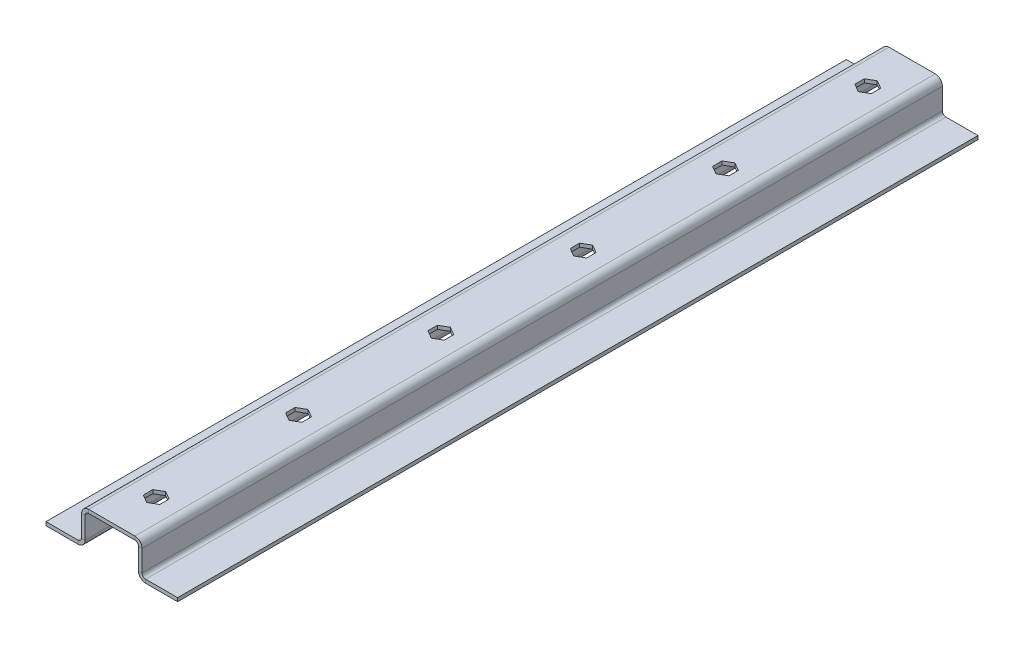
ISO-10303-21;
HEADER;
FILE_DESCRIPTION(('STEP AP214'),'2;1');
FILE_NAME('part.step','',(''),(''),'','','');
FILE_SCHEMA(('AUTOMOTIVE_DESIGN { 1 0 10303 214 1 1 1 1 }'));
ENDSEC;
DATA;
#1=APPLICATION_CONTEXT('core data for automotive mechanical design processes');
#2=APPLICATION_PROTOCOL_DEFINITION('international standard','automotive_design',2000,#1);
#3=PRODUCT_CONTEXT('',#1,'mechanical');
#4=PRODUCT('Part','Part','',(#3));
#5=PRODUCT_RELATED_PRODUCT_CATEGORY('part','',(#4));
#6=PRODUCT_DEFINITION_FORMATION('','',#4);
#7=PRODUCT_DEFINITION_CONTEXT('part definition',#1,'design');
#8=PRODUCT_DEFINITION('design','',#6,#7);
#9=PRODUCT_DEFINITION_SHAPE('','',#8);
#10=(LENGTH_UNIT() NAMED_UNIT(*) SI_UNIT(.MILLI.,.METRE.));
#11=(NAMED_UNIT(*) PLANE_ANGLE_UNIT() SI_UNIT($,.RADIAN.));
#12=(NAMED_UNIT(*) SI_UNIT($,.STERADIAN.) SOLID_ANGLE_UNIT());
#13=UNCERTAINTY_MEASURE_WITH_UNIT(LENGTH_MEASURE(1.E-05),#10,'distance_accuracy_value','');
#14=(GEOMETRIC_REPRESENTATION_CONTEXT(3) GLOBAL_UNCERTAINTY_ASSIGNED_CONTEXT((#13)) GLOBAL_UNIT_ASSIGNED_CONTEXT((#10,
#11,#12)) REPRESENTATION_CONTEXT('',''));
#15=CARTESIAN_POINT('',(0.,0.,0.));
#16=DIRECTION('',(0.,0.,1.));
#17=DIRECTION('',(1.,0.,0.));
#18=AXIS2_PLACEMENT_3D('',#15,#16,#17);
#19=CARTESIAN_POINT('',(40.4226451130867,-9.000000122,585.));
#20=DIRECTION('',(0.,-1.,0.));
#21=DIRECTION('',(0.,0.,-1.));
#22=AXIS2_PLACEMENT_3D('',#19,#20,#21);
#23=PLANE('',#22);
#24=DIRECTION('',(0.86602540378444,0.,-0.499999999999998));
#25=VECTOR('',#24,1.);
#26=CARTESIAN_POINT('',(1.28922433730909E-13,-9.00000012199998,490.301622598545));
#27=LINE('',#26,#25);
#28=CARTESIAN_POINT('',(1.30104260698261E-13,-9.000000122,490.301622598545));
#29=VERTEX_POINT('',#28);
#30=CARTESIAN_POINT('',(4.60000000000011,-9.00000012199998,487.645811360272));
#31=VERTEX_POINT('',#30);
#32=EDGE_CURVE('E411',#29,#31,#27,.T.);
#33=ORIENTED_EDGE('',*,*,#32,.F.);
#34=DIRECTION('',(0.866025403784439,0.,0.5));
#35=VECTOR('',#34,1.);
#36=CARTESIAN_POINT('',(-4.59999999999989,-9.00000012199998,487.645811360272));
#37=LINE('',#36,#35);
#38=CARTESIAN_POINT('',(-4.59999999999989,-9.00000012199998,487.645811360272));
#39=VERTEX_POINT('',#38);
#40=EDGE_CURVE('E54',#39,#29,#37,.T.);
#41=ORIENTED_EDGE('',*,*,#40,.F.);
#42=DIRECTION('',(0.,0.,1.));
#43=VECTOR('',#42,1.);
#44=CARTESIAN_POINT('',(-4.59999999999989,-9.00000012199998,482.334188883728));
#45=LINE('',#44,#43);
#46=CARTESIAN_POINT('',(-4.59999999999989,-9.00000012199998,482.334188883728));
#47=VERTEX_POINT('',#46);
#48=EDGE_CURVE('E403',#47,#39,#45,.T.);
#49=ORIENTED_EDGE('',*,*,#48,.F.);
#50=DIRECTION('',(-0.866025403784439,0.,0.5));
#51=VECTOR('',#50,1.);
#52=CARTESIAN_POINT('',(1.22569574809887E-13,-9.00000012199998,479.678377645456));
#53=LINE('',#52,#51);
#54=CARTESIAN_POINT('',(1.22569574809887E-13,-9.00000012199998,479.678377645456));
#55=VERTEX_POINT('',#54);
#56=EDGE_CURVE('E424',#55,#47,#53,.T.);
#57=ORIENTED_EDGE('',*,*,#56,.F.);
#58=DIRECTION('',(-0.866025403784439,0.,-0.5));
#59=VECTOR('',#58,1.);
#60=CARTESIAN_POINT('',(4.60000000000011,-9.00000012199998,482.334188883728));
#61=LINE('',#60,#59);
#62=CARTESIAN_POINT('',(4.60000000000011,-9.00000012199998,482.334188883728));
#63=VERTEX_POINT('',#62);
#64=EDGE_CURVE('E421',#63,#55,#61,.T.);
#65=ORIENTED_EDGE('',*,*,#64,.F.);
#66=DIRECTION('',(0.,0.,-1.));
#67=VECTOR('',#66,1.);
#68=CARTESIAN_POINT('',(4.60000000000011,-9.00000012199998,487.645811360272));
#69=LINE('',#68,#67);
#70=EDGE_CURVE('E418',#31,#63,#69,.T.);
#71=ORIENTED_EDGE('',*,*,#70,.F.);
#72=EDGE_LOOP('',(#33,#41,#49,#57,#65,#71));
#73=FACE_BOUND('',#72,.T.);
#74=DIRECTION('',(0.86602540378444,0.,-0.499999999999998));
#75=VECTOR('',#74,1.);
#76=CARTESIAN_POINT('',(1.32623639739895E-13,-9.00000012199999,410.291622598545));
#77=LINE('',#76,#75);
#78=CARTESIAN_POINT('',(1.31838984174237E-13,-9.000000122,410.291622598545));
#79=VERTEX_POINT('',#78);
#80=CARTESIAN_POINT('',(4.60000000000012,-9.00000012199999,407.635811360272));
#81=VERTEX_POINT('',#80);
#82=EDGE_CURVE('E453',#79,#81,#77,.T.);
#83=ORIENTED_EDGE('',*,*,#82,.F.);
#84=DIRECTION('',(0.866025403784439,0.,0.5));
#85=VECTOR('',#84,1.);
#86=CARTESIAN_POINT('',(-4.59999999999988,-9.00000012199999,407.635811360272));
#87=LINE('',#86,#85);
#88=CARTESIAN_POINT('',(-4.59999999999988,-9.00000012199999,407.635811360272));
#89=VERTEX_POINT('',#88);
#90=EDGE_CURVE('E451',#89,#79,#87,.T.);
#91=ORIENTED_EDGE('',*,*,#90,.F.);
#92=DIRECTION('',(0.,0.,1.));
#93=VECTOR('',#92,1.);
#94=CARTESIAN_POINT('',(-4.59999999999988,-9.00000012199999,402.324188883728));
#95=LINE('',#94,#93);
#96=CARTESIAN_POINT('',(-4.59999999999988,-9.00000012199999,402.324188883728));
#97=VERTEX_POINT('',#96);
#98=EDGE_CURVE('E465',#97,#89,#95,.T.);
#99=ORIENTED_EDGE('',*,*,#98,.F.);
#100=DIRECTION('',(-0.866025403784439,0.,0.5));
#101=VECTOR('',#100,1.);
#102=CARTESIAN_POINT('',(1.26270780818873E-13,-9.00000012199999,399.668377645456));
#103=LINE('',#102,#101);
#104=CARTESIAN_POINT('',(1.26270780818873E-13,-9.00000012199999,399.668377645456));
#105=VERTEX_POINT('',#104);
#106=EDGE_CURVE('E462',#105,#97,#103,.T.);
#107=ORIENTED_EDGE('',*,*,#106,.F.);
#108=DIRECTION('',(-0.866025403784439,0.,-0.5));
#109=VECTOR('',#108,1.);
#110=CARTESIAN_POINT('',(4.60000000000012,-9.00000012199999,402.324188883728));
#111=LINE('',#110,#109);
#112=CARTESIAN_POINT('',(4.60000000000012,-9.00000012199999,402.324188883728));
#113=VERTEX_POINT('',#112);
#114=EDGE_CURVE('E459',#113,#105,#111,.T.);
#115=ORIENTED_EDGE('',*,*,#114,.F.);
#116=DIRECTION('',(0.,0.,-1.));
#117=VECTOR('',#116,1.);
#118=CARTESIAN_POINT('',(4.60000000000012,-9.00000012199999,407.635811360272));
#119=LINE('',#118,#117);
#120=EDGE_CURVE('E456',#81,#113,#119,.T.);
#121=ORIENTED_EDGE('',*,*,#120,.F.);
#122=EDGE_LOOP('',(#83,#91,#99,#107,#115,#121));
#123=FACE_BOUND('',#122,.T.);
#124=DIRECTION('',(0.86602540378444,0.,-0.499999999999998));
#125=VECTOR('',#124,1.);
#126=CARTESIAN_POINT('',(1.36324845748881E-13,-9.00000012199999,330.281622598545));
#127=LINE('',#126,#125);
#128=CARTESIAN_POINT('',(1.38777878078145E-13,-9.000000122,330.281622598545));
#129=VERTEX_POINT('',#128);
#130=CARTESIAN_POINT('',(4.60000000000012,-9.00000012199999,327.625811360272));
#131=VERTEX_POINT('',#130);
#132=EDGE_CURVE('E501',#129,#131,#127,.T.);
#133=ORIENTED_EDGE('',*,*,#132,.F.);
#134=DIRECTION('',(0.866025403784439,0.,0.5));
#135=VECTOR('',#134,1.);
#136=CARTESIAN_POINT('',(-4.59999999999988,-9.00000012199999,327.625811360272));
#137=LINE('',#136,#135);
#138=CARTESIAN_POINT('',(-4.59999999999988,-9.00000012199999,327.625811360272));
#139=VERTEX_POINT('',#138);
#140=EDGE_CURVE('E499',#139,#129,#137,.T.);
#141=ORIENTED_EDGE('',*,*,#140,.F.);
#142=DIRECTION('',(0.,0.,1.));
#143=VECTOR('',#142,1.);
#144=CARTESIAN_POINT('',(-4.59999999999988,-9.00000012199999,322.314188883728));
#145=LINE('',#144,#143);
#146=CARTESIAN_POINT('',(-4.59999999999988,-9.00000012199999,322.314188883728));
#147=VERTEX_POINT('',#146);
#148=EDGE_CURVE('E513',#147,#139,#145,.T.);
#149=ORIENTED_EDGE('',*,*,#148,.F.);
#150=DIRECTION('',(-0.866025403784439,0.,0.5));
#151=VECTOR('',#150,1.);
#152=CARTESIAN_POINT('',(1.29971986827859E-13,-9.00000012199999,319.658377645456));
#153=LINE('',#152,#151);
#154=CARTESIAN_POINT('',(1.29971986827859E-13,-9.00000012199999,319.658377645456));
#155=VERTEX_POINT('',#154);
#156=EDGE_CURVE('E510',#155,#147,#153,.T.);
#157=ORIENTED_EDGE('',*,*,#156,.F.);
#158=DIRECTION('',(-0.866025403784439,0.,-0.5));
#159=VECTOR('',#158,1.);
#160=CARTESIAN_POINT('',(4.60000000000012,-9.00000012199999,322.314188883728));
#161=LINE('',#160,#159);
#162=CARTESIAN_POINT('',(4.60000000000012,-9.00000012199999,322.314188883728));
#163=VERTEX_POINT('',#162);
#164=EDGE_CURVE('E507',#163,#155,#161,.T.);
#165=ORIENTED_EDGE('',*,*,#164,.F.);
#166=DIRECTION('',(0.,0.,-1.));
#167=VECTOR('',#166,1.);
#168=CARTESIAN_POINT('',(4.60000000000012,-9.00000012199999,327.625811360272));
#169=LINE('',#168,#167);
#170=EDGE_CURVE('E504',#131,#163,#169,.T.);
#171=ORIENTED_EDGE('',*,*,#170,.F.);
#172=EDGE_LOOP('',(#133,#141,#149,#157,#165,#171));
#173=FACE_BOUND('',#172,.T.);
#174=DIRECTION('',(0.86602540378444,0.,-0.499999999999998));
#175=VECTOR('',#174,1.);
#176=CARTESIAN_POINT('',(1.40026051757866E-13,-9.00000012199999,250.271622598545));
#177=LINE('',#176,#175);
#178=CARTESIAN_POINT('',(1.52655665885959E-13,-9.000000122,250.271622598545));
#179=VERTEX_POINT('',#178);
#180=CARTESIAN_POINT('',(4.60000000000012,-9.00000012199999,247.615811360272));
#181=VERTEX_POINT('',#180);
#182=EDGE_CURVE('E549',#179,#181,#177,.T.);
#183=ORIENTED_EDGE('',*,*,#182,.F.);
#184=DIRECTION('',(0.866025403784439,0.,0.5));
#185=VECTOR('',#184,1.);
#186=CARTESIAN_POINT('',(-4.59999999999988,-9.00000012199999,247.615811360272));
#187=LINE('',#186,#185);
#188=CARTESIAN_POINT('',(-4.59999999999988,-9.00000012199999,247.615811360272));
#189=VERTEX_POINT('',#188);
#190=EDGE_CURVE('E547',#189,#179,#187,.T.);
#191=ORIENTED_EDGE('',*,*,#190,.F.);
#192=DIRECTION('',(0.,0.,1.));
#193=VECTOR('',#192,1.);
#194=CARTESIAN_POINT('',(-4.59999999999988,-9.00000012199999,242.304188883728));
#195=LINE('',#194,#193);
#196=CARTESIAN_POINT('',(-4.59999999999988,-9.00000012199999,242.304188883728));
#197=VERTEX_POINT('',#196);
#198=EDGE_CURVE('E561',#197,#189,#195,.T.);
#199=ORIENTED_EDGE('',*,*,#198,.F.);
#200=DIRECTION('',(-0.866025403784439,0.,0.5));
#201=VECTOR('',#200,1.);
#202=CARTESIAN_POINT('',(1.33673192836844E-13,-9.00000012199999,239.648377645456));
#203=LINE('',#202,#201);
#204=CARTESIAN_POINT('',(1.33673192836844E-13,-9.00000012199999,239.648377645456));
#205=VERTEX_POINT('',#204);
#206=EDGE_CURVE('E558',#205,#197,#203,.T.);
#207=ORIENTED_EDGE('',*,*,#206,.F.);
#208=DIRECTION('',(-0.866025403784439,0.,-0.5));
#209=VECTOR('',#208,1.);
#210=CARTESIAN_POINT('',(4.60000000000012,-9.00000012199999,242.304188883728));
#211=LINE('',#210,#209);
#212=CARTESIAN_POINT('',(4.60000000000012,-9.00000012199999,242.304188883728));
#213=VERTEX_POINT('',#212);
#214=EDGE_CURVE('E555',#213,#205,#211,.T.);
#215=ORIENTED_EDGE('',*,*,#214,.F.);
#216=DIRECTION('',(0.,0.,-1.));
#217=VECTOR('',#216,1.);
#218=CARTESIAN_POINT('',(4.60000000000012,-9.00000012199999,247.615811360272));
#219=LINE('',#218,#217);
#220=EDGE_CURVE('E552',#181,#213,#219,.T.);
#221=ORIENTED_EDGE('',*,*,#220,.F.);
#222=EDGE_LOOP('',(#183,#191,#199,#207,#215,#221));
#223=FACE_BOUND('',#222,.T.);
#224=DIRECTION('',(0.86602540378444,0.,-0.499999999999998));
#225=VECTOR('',#224,1.);
#226=CARTESIAN_POINT('',(1.43727257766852E-13,-9.000000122,170.261622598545));
#227=LINE('',#226,#225);
#228=CARTESIAN_POINT('',(1.66533453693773E-13,-9.000000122,170.261622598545));
#229=VERTEX_POINT('',#228);
#230=CARTESIAN_POINT('',(4.60000000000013,-9.000000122,167.605811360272));
#231=VERTEX_POINT('',#230);
#232=EDGE_CURVE('E597',#229,#231,#227,.T.);
#233=ORIENTED_EDGE('',*,*,#232,.F.);
#234=DIRECTION('',(0.866025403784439,0.,0.5));
#235=VECTOR('',#234,1.);
#236=CARTESIAN_POINT('',(-4.59999999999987,-9.000000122,167.605811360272));
#237=LINE('',#236,#235);
#238=CARTESIAN_POINT('',(-4.59999999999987,-9.000000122,167.605811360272));
#239=VERTEX_POINT('',#238);
#240=EDGE_CURVE('E595',#239,#229,#237,.T.);
#241=ORIENTED_EDGE('',*,*,#240,.F.);
#242=DIRECTION('',(0.,0.,1.));
#243=VECTOR('',#242,1.);
#244=CARTESIAN_POINT('',(-4.59999999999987,-9.000000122,162.294188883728));
#245=LINE('',#244,#243);
#246=CARTESIAN_POINT('',(-4.59999999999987,-9.000000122,162.294188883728));
#247=VERTEX_POINT('',#246);
#248=EDGE_CURVE('E609',#247,#239,#245,.T.);
#249=ORIENTED_EDGE('',*,*,#248,.F.);
#250=DIRECTION('',(-0.866025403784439,0.,0.5));
#251=VECTOR('',#250,1.);
#252=CARTESIAN_POINT('',(1.3737439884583E-13,-9.000000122,159.638377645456));
#253=LINE('',#252,#251);
#254=CARTESIAN_POINT('',(1.3737439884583E-13,-9.000000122,159.638377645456));
#255=VERTEX_POINT('',#254);
#256=EDGE_CURVE('E606',#255,#247,#253,.T.);
#257=ORIENTED_EDGE('',*,*,#256,.F.);
#258=DIRECTION('',(-0.866025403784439,0.,-0.5));
#259=VECTOR('',#258,1.);
#260=CARTESIAN_POINT('',(4.60000000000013,-9.000000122,162.294188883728));
#261=LINE('',#260,#259);
#262=CARTESIAN_POINT('',(4.60000000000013,-9.000000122,162.294188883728));
#263=VERTEX_POINT('',#262);
#264=EDGE_CURVE('E603',#263,#255,#261,.T.);
#265=ORIENTED_EDGE('',*,*,#264,.F.);
#266=DIRECTION('',(0.,0.,-1.));
#267=VECTOR('',#266,1.);
#268=CARTESIAN_POINT('',(4.60000000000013,-9.000000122,167.605811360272));
#269=LINE('',#268,#267);
#270=EDGE_CURVE('E600',#231,#263,#269,.T.);
#271=ORIENTED_EDGE('',*,*,#270,.F.);
#272=EDGE_LOOP('',(#233,#241,#249,#257,#265,#271));
#273=FACE_BOUND('',#272,.T.);
#274=DIRECTION('',(0.,0.,1.));
#275=VECTOR('',#274,1.);
#276=CARTESIAN_POINT('',(13.,-9.000000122,15.));
#277=LINE('',#276,#275);
#278=CARTESIAN_POINT('',(13.0000000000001,-9.000000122,59.965000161));
#279=VERTEX_POINT('',#278);
#280=CARTESIAN_POINT('',(13.0000000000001,-9.000000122,509.965000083));
#281=VERTEX_POINT('',#280);
#282=EDGE_CURVE('E734',#279,#281,#277,.T.);
#283=ORIENTED_EDGE('',*,*,#282,.F.);
#284=DIRECTION('',(-1.,0.,0.));
#285=VECTOR('',#284,1.);
#286=CARTESIAN_POINT('',(-71.1242215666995,-9.000000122,59.965000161));
#287=LINE('',#286,#285);
#288=CARTESIAN_POINT('',(-13.,-9.000000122,59.9650001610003));
#289=VERTEX_POINT('',#288);
#290=EDGE_CURVE('E737',#289,#279,#287,.F.);
#291=ORIENTED_EDGE('',*,*,#290,.F.);
#292=DIRECTION('',(0.,0.,-1.));
#293=VECTOR('',#292,1.);
#294=CARTESIAN_POINT('',(-13.0000000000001,-9.000000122,585.));
#295=LINE('',#294,#293);
#296=CARTESIAN_POINT('',(-13.,-9.000000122,509.965000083));
#297=VERTEX_POINT('',#296);
#298=EDGE_CURVE('E740',#297,#289,#295,.T.);
#299=ORIENTED_EDGE('',*,*,#298,.F.);
#300=DIRECTION('',(1.,0.,0.));
#301=VECTOR('',#300,1.);
#302=CARTESIAN_POINT('',(-71.1242215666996,-9.000000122,509.965000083));
#303=LINE('',#302,#301);
#304=EDGE_CURVE('E743',#281,#297,#303,.F.);
#305=ORIENTED_EDGE('',*,*,#304,.F.);
#306=EDGE_LOOP('',(#283,#291,#299,#305));
#307=FACE_BOUND('',#306,.T.);
#308=DIRECTION('',(0.,0.,-1.));
#309=VECTOR('',#308,1.);
#310=CARTESIAN_POINT('',(-4.59999999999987,-9.000000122,619.058772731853));
#311=LINE('',#310,#309);
#312=CARTESIAN_POINT('',(-4.59999999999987,-9.000000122,82.2841888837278));
#313=VERTEX_POINT('',#312);
#314=CARTESIAN_POINT('',(-4.59999999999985,-9.000000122,87.5958113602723));
#315=VERTEX_POINT('',#314);
#316=EDGE_CURVE('E640',#313,#315,#311,.F.);
#317=ORIENTED_EDGE('',*,*,#316,.F.);
#318=DIRECTION('',(-0.866025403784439,0.,0.5));
#319=VECTOR('',#318,1.);
#320=CARTESIAN_POINT('',(1.41075604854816E-13,-9.000000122,79.6283776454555));
#321=LINE('',#320,#319);
#322=CARTESIAN_POINT('',(1.38777878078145E-13,-9.000000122,79.6283776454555));
#323=VERTEX_POINT('',#322);
#324=EDGE_CURVE('E638',#323,#313,#321,.T.);
#325=ORIENTED_EDGE('',*,*,#324,.F.);
#326=DIRECTION('',(-0.866025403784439,0.,-0.5));
#327=VECTOR('',#326,1.);
#328=CARTESIAN_POINT('',(4.60000000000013,-9.000000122,82.2841888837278));
#329=LINE('',#328,#327);
#330=CARTESIAN_POINT('',(4.60000000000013,-9.000000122,82.2841888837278));
#331=VERTEX_POINT('',#330);
#332=EDGE_CURVE('E636',#331,#323,#329,.T.);
#333=ORIENTED_EDGE('',*,*,#332,.F.);
#334=DIRECTION('',(0.,0.,-1.));
#335=VECTOR('',#334,1.);
#336=CARTESIAN_POINT('',(4.60000000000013,-9.000000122,619.058772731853));
#337=LINE('',#336,#335);
#338=CARTESIAN_POINT('',(4.60000000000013,-9.000000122,87.5958113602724));
#339=VERTEX_POINT('',#338);
#340=EDGE_CURVE('E633',#339,#331,#337,.T.);
#341=ORIENTED_EDGE('',*,*,#340,.F.);
#342=DIRECTION('',(0.86602540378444,0.,-0.499999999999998));
#343=VECTOR('',#342,1.);
#344=CARTESIAN_POINT('',(1.47428463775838E-13,-9.000000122,90.2516225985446));
#345=LINE('',#344,#343);
#346=CARTESIAN_POINT('',(1.66533453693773E-13,-9.000000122,90.2516225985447));
#347=VERTEX_POINT('',#346);
#348=EDGE_CURVE('E629',#347,#339,#345,.T.);
#349=ORIENTED_EDGE('',*,*,#348,.F.);
#350=DIRECTION('',(0.866025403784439,0.,0.5));
#351=VECTOR('',#350,1.);
#352=CARTESIAN_POINT('',(-4.59999999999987,-9.000000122,87.5958113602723));
#353=LINE('',#352,#351);
#354=EDGE_CURVE('E631',#315,#347,#353,.T.);
#355=ORIENTED_EDGE('',*,*,#354,.F.);
#356=EDGE_LOOP('',(#317,#325,#333,#341,#349,#355));
#357=FACE_BOUND('',#356,.T.);
#358=ADVANCED_FACE('F37',(#73,#123,#173,#223,#273,#307,#357),#23,.F.);
#359=CARTESIAN_POINT('',(17.,-11.000000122,619.058772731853));
#360=DIRECTION('',(0.,-1.,0.));
#361=DIRECTION('',(0.,0.,-1.));
#362=AXIS2_PLACEMENT_3D('',#359,#360,#361);
#363=PLANE('',#362);
#364=DIRECTION('',(0.866025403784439,0.,0.5));
#365=VECTOR('',#364,1.);
#366=CARTESIAN_POINT('',(-4.59999999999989,-11.000000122,487.645811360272));
#367=LINE('',#366,#365);
#368=CARTESIAN_POINT('',(-4.59999999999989,-11.000000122,487.645811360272));
#369=VERTEX_POINT('',#368);
#370=CARTESIAN_POINT('',(1.28922428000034E-13,-11.000000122,490.301622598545));
#371=VERTEX_POINT('',#370);
#372=EDGE_CURVE('E401',#369,#371,#367,.T.);
#373=ORIENTED_EDGE('',*,*,#372,.T.);
#374=DIRECTION('',(0.86602540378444,0.,-0.499999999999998));
#375=VECTOR('',#374,1.);
#376=CARTESIAN_POINT('',(1.28922433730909E-13,-11.000000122,490.301622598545));
#377=LINE('',#376,#375);
#378=CARTESIAN_POINT('',(4.60000000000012,-11.000000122,487.645811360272));
#379=VERTEX_POINT('',#378);
#380=EDGE_CURVE('E390',#371,#379,#377,.T.);
#381=ORIENTED_EDGE('',*,*,#380,.T.);
#382=DIRECTION('',(0.,0.,-1.));
#383=VECTOR('',#382,1.);
#384=CARTESIAN_POINT('',(4.60000000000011,-11.000000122,487.645811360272));
#385=LINE('',#384,#383);
#386=CARTESIAN_POINT('',(4.60000000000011,-11.000000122,482.334188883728));
#387=VERTEX_POINT('',#386);
#388=EDGE_CURVE('E1831',#379,#387,#385,.T.);
#389=ORIENTED_EDGE('',*,*,#388,.T.);
#390=DIRECTION('',(-0.866025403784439,0.,-0.5));
#391=VECTOR('',#390,1.);
#392=CARTESIAN_POINT('',(4.60000000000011,-11.000000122,482.334188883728));
#393=LINE('',#392,#391);
#394=CARTESIAN_POINT('',(1.23165366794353E-13,-11.000000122,479.678377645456));
#395=VERTEX_POINT('',#394);
#396=EDGE_CURVE('E1836',#387,#395,#393,.T.);
#397=ORIENTED_EDGE('',*,*,#396,.T.);
#398=DIRECTION('',(-0.866025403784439,0.,0.5));
#399=VECTOR('',#398,1.);
#400=CARTESIAN_POINT('',(1.22569574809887E-13,-11.000000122,479.678377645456));
#401=LINE('',#400,#399);
#402=CARTESIAN_POINT('',(-4.59999999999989,-11.000000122,482.334188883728));
#403=VERTEX_POINT('',#402);
#404=EDGE_CURVE('E413',#395,#403,#401,.T.);
#405=ORIENTED_EDGE('',*,*,#404,.T.);
#406=DIRECTION('',(0.,0.,1.));
#407=VECTOR('',#406,1.);
#408=CARTESIAN_POINT('',(-4.59999999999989,-11.000000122,482.334188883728));
#409=LINE('',#408,#407);
#410=EDGE_CURVE('E409',#403,#369,#409,.T.);
#411=ORIENTED_EDGE('',*,*,#410,.T.);
#412=EDGE_LOOP('',(#373,#381,#389,#397,#405,#411));
#413=FACE_BOUND('',#412,.T.);
#414=DIRECTION('',(0.866025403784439,0.,0.5));
#415=VECTOR('',#414,1.);
#416=CARTESIAN_POINT('',(-4.59999999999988,-11.000000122,407.635811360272));
#417=LINE('',#416,#415);
#418=CARTESIAN_POINT('',(-4.59999999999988,-11.000000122,407.635811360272));
#419=VERTEX_POINT('',#418);
#420=CARTESIAN_POINT('',(1.3262363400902E-13,-11.000000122,410.291622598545));
#421=VERTEX_POINT('',#420);
#422=EDGE_CURVE('E448',#419,#421,#417,.T.);
#423=ORIENTED_EDGE('',*,*,#422,.T.);
#424=DIRECTION('',(0.86602540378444,0.,-0.499999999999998));
#425=VECTOR('',#424,1.);
#426=CARTESIAN_POINT('',(1.32623639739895E-13,-11.000000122,410.291622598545));
#427=LINE('',#426,#425);
#428=CARTESIAN_POINT('',(4.60000000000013,-11.000000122,407.635811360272));
#429=VERTEX_POINT('',#428);
#430=EDGE_CURVE('E471',#421,#429,#427,.T.);
#431=ORIENTED_EDGE('',*,*,#430,.T.);
#432=DIRECTION('',(0.,0.,-1.));
#433=VECTOR('',#432,1.);
#434=CARTESIAN_POINT('',(4.60000000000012,-11.000000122,407.635811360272));
#435=LINE('',#434,#433);
#436=CARTESIAN_POINT('',(4.60000000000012,-11.000000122,402.324188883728));
#437=VERTEX_POINT('',#436);
#438=EDGE_CURVE('E397',#429,#437,#435,.T.);
#439=ORIENTED_EDGE('',*,*,#438,.T.);
#440=DIRECTION('',(-0.866025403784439,0.,-0.5));
#441=VECTOR('',#440,1.);
#442=CARTESIAN_POINT('',(4.60000000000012,-11.000000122,402.324188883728));
#443=LINE('',#442,#441);
#444=CARTESIAN_POINT('',(1.25767452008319E-13,-11.000000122,399.668377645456));
#445=VERTEX_POINT('',#444);
#446=EDGE_CURVE('E439',#437,#445,#443,.T.);
#447=ORIENTED_EDGE('',*,*,#446,.T.);
#448=DIRECTION('',(-0.866025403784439,0.,0.5));
#449=VECTOR('',#448,1.);
#450=CARTESIAN_POINT('',(1.26270780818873E-13,-11.000000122,399.668377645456));
#451=LINE('',#450,#449);
#452=CARTESIAN_POINT('',(-4.59999999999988,-11.000000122,402.324188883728));
#453=VERTEX_POINT('',#452);
#454=EDGE_CURVE('E442',#445,#453,#451,.T.);
#455=ORIENTED_EDGE('',*,*,#454,.T.);
#456=DIRECTION('',(0.,0.,1.));
#457=VECTOR('',#456,1.);
#458=CARTESIAN_POINT('',(-4.59999999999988,-11.000000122,402.324188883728));
#459=LINE('',#458,#457);
#460=EDGE_CURVE('E445',#453,#419,#459,.T.);
#461=ORIENTED_EDGE('',*,*,#460,.T.);
#462=EDGE_LOOP('',(#423,#431,#439,#447,#455,#461));
#463=FACE_BOUND('',#462,.T.);
#464=DIRECTION('',(0.866025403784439,0.,0.5));
#465=VECTOR('',#464,1.);
#466=CARTESIAN_POINT('',(-4.59999999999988,-11.000000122,327.625811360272));
#467=LINE('',#466,#465);
#468=CARTESIAN_POINT('',(-4.59999999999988,-11.000000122,327.625811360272));
#469=VERTEX_POINT('',#468);
#470=CARTESIAN_POINT('',(1.36324840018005E-13,-11.000000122,330.281622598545));
#471=VERTEX_POINT('',#470);
#472=EDGE_CURVE('E496',#469,#471,#467,.T.);
#473=ORIENTED_EDGE('',*,*,#472,.T.);
#474=DIRECTION('',(0.86602540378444,0.,-0.499999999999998));
#475=VECTOR('',#474,1.);
#476=CARTESIAN_POINT('',(1.36324845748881E-13,-11.000000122,330.281622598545));
#477=LINE('',#476,#475);
#478=CARTESIAN_POINT('',(4.60000000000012,-11.000000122,327.625811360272));
#479=VERTEX_POINT('',#478);
#480=EDGE_CURVE('E519',#471,#479,#477,.T.);
#481=ORIENTED_EDGE('',*,*,#480,.T.);
#482=DIRECTION('',(0.,0.,-1.));
#483=VECTOR('',#482,1.);
#484=CARTESIAN_POINT('',(4.60000000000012,-11.000000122,327.625811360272));
#485=LINE('',#484,#483);
#486=CARTESIAN_POINT('',(4.60000000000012,-11.000000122,322.314188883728));
#487=VERTEX_POINT('',#486);
#488=EDGE_CURVE('E484',#479,#487,#485,.T.);
#489=ORIENTED_EDGE('',*,*,#488,.T.);
#490=DIRECTION('',(-0.866025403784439,0.,-0.5));
#491=VECTOR('',#490,1.);
#492=CARTESIAN_POINT('',(4.60000000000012,-11.000000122,322.314188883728));
#493=LINE('',#492,#491);
#494=CARTESIAN_POINT('',(1.30104260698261E-13,-11.000000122,319.658377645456));
#495=VERTEX_POINT('',#494);
#496=EDGE_CURVE('E487',#487,#495,#493,.T.);
#497=ORIENTED_EDGE('',*,*,#496,.T.);
#498=DIRECTION('',(-0.866025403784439,0.,0.5));
#499=VECTOR('',#498,1.);
#500=CARTESIAN_POINT('',(1.29971986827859E-13,-11.000000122,319.658377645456));
#501=LINE('',#500,#499);
#502=CARTESIAN_POINT('',(-4.59999999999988,-11.000000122,322.314188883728));
#503=VERTEX_POINT('',#502);
#504=EDGE_CURVE('E490',#495,#503,#501,.T.);
#505=ORIENTED_EDGE('',*,*,#504,.T.);
#506=DIRECTION('',(0.,0.,1.));
#507=VECTOR('',#506,1.);
#508=CARTESIAN_POINT('',(-4.59999999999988,-11.000000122,322.314188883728));
#509=LINE('',#508,#507);
#510=EDGE_CURVE('E493',#503,#469,#509,.T.);
#511=ORIENTED_EDGE('',*,*,#510,.T.);
#512=EDGE_LOOP('',(#473,#481,#489,#497,#505,#511));
#513=FACE_BOUND('',#512,.T.);
#514=DIRECTION('',(0.866025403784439,0.,0.5));
#515=VECTOR('',#514,1.);
#516=CARTESIAN_POINT('',(-4.59999999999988,-11.000000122,247.615811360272));
#517=LINE('',#516,#515);
#518=CARTESIAN_POINT('',(-4.59999999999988,-11.000000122,247.615811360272));
#519=VERTEX_POINT('',#518);
#520=CARTESIAN_POINT('',(1.40026046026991E-13,-11.000000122,250.271622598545));
#521=VERTEX_POINT('',#520);
#522=EDGE_CURVE('E544',#519,#521,#517,.T.);
#523=ORIENTED_EDGE('',*,*,#522,.T.);
#524=DIRECTION('',(0.86602540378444,0.,-0.499999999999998));
#525=VECTOR('',#524,1.);
#526=CARTESIAN_POINT('',(1.40026051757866E-13,-11.000000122,250.271622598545));
#527=LINE('',#526,#525);
#528=CARTESIAN_POINT('',(4.60000000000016,-11.000000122,247.615811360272));
#529=VERTEX_POINT('',#528);
#530=EDGE_CURVE('E567',#521,#529,#527,.T.);
#531=ORIENTED_EDGE('',*,*,#530,.T.);
#532=DIRECTION('',(0.,0.,-1.));
#533=VECTOR('',#532,1.);
#534=CARTESIAN_POINT('',(4.60000000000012,-11.000000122,247.615811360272));
#535=LINE('',#534,#533);
#536=CARTESIAN_POINT('',(4.60000000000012,-11.000000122,242.304188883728));
#537=VERTEX_POINT('',#536);
#538=EDGE_CURVE('E532',#529,#537,#535,.T.);
#539=ORIENTED_EDGE('',*,*,#538,.T.);
#540=DIRECTION('',(-0.866025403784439,0.,-0.5));
#541=VECTOR('',#540,1.);
#542=CARTESIAN_POINT('',(4.60000000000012,-11.000000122,242.304188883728));
#543=LINE('',#542,#541);
#544=CARTESIAN_POINT('',(1.34441069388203E-13,-11.000000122,239.648377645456));
#545=VERTEX_POINT('',#544);
#546=EDGE_CURVE('E535',#537,#545,#543,.T.);
#547=ORIENTED_EDGE('',*,*,#546,.T.);
#548=DIRECTION('',(-0.866025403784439,0.,0.5));
#549=VECTOR('',#548,1.);
#550=CARTESIAN_POINT('',(1.33673192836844E-13,-11.000000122,239.648377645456));
#551=LINE('',#550,#549);
#552=CARTESIAN_POINT('',(-4.59999999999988,-11.000000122,242.304188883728));
#553=VERTEX_POINT('',#552);
#554=EDGE_CURVE('E538',#545,#553,#551,.T.);
#555=ORIENTED_EDGE('',*,*,#554,.T.);
#556=DIRECTION('',(0.,0.,1.));
#557=VECTOR('',#556,1.);
#558=CARTESIAN_POINT('',(-4.59999999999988,-11.000000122,242.304188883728));
#559=LINE('',#558,#557);
#560=EDGE_CURVE('E541',#553,#519,#559,.T.);
#561=ORIENTED_EDGE('',*,*,#560,.T.);
#562=EDGE_LOOP('',(#523,#531,#539,#547,#555,#561));
#563=FACE_BOUND('',#562,.T.);
#564=DIRECTION('',(0.866025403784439,0.,0.5));
#565=VECTOR('',#564,1.);
#566=CARTESIAN_POINT('',(-4.59999999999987,-11.000000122,167.605811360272));
#567=LINE('',#566,#565);
#568=CARTESIAN_POINT('',(-4.59999999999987,-11.000000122,167.605811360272));
#569=VERTEX_POINT('',#568);
#570=CARTESIAN_POINT('',(1.43727252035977E-13,-11.000000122,170.261622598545));
#571=VERTEX_POINT('',#570);
#572=EDGE_CURVE('E592',#569,#571,#567,.T.);
#573=ORIENTED_EDGE('',*,*,#572,.T.);
#574=DIRECTION('',(0.86602540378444,0.,-0.499999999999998));
#575=VECTOR('',#574,1.);
#576=CARTESIAN_POINT('',(1.43727257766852E-13,-11.000000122,170.261622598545));
#577=LINE('',#576,#575);
#578=CARTESIAN_POINT('',(4.60000000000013,-11.000000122,167.605811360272));
#579=VERTEX_POINT('',#578);
#580=EDGE_CURVE('E615',#571,#579,#577,.T.);
#581=ORIENTED_EDGE('',*,*,#580,.T.);
#582=DIRECTION('',(0.,0.,-1.));
#583=VECTOR('',#582,1.);
#584=CARTESIAN_POINT('',(4.60000000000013,-11.000000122,167.605811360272));
#585=LINE('',#584,#583);
#586=CARTESIAN_POINT('',(4.60000000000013,-11.000000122,162.294188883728));
#587=VERTEX_POINT('',#586);
#588=EDGE_CURVE('E580',#579,#587,#585,.T.);
#589=ORIENTED_EDGE('',*,*,#588,.T.);
#590=DIRECTION('',(-0.866025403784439,0.,-0.5));
#591=VECTOR('',#590,1.);
#592=CARTESIAN_POINT('',(4.60000000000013,-11.000000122,162.294188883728));
#593=LINE('',#592,#591);
#594=CARTESIAN_POINT('',(1.37043154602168E-13,-11.000000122,159.638377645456));
#595=VERTEX_POINT('',#594);
#596=EDGE_CURVE('E583',#587,#595,#593,.T.);
#597=ORIENTED_EDGE('',*,*,#596,.T.);
#598=DIRECTION('',(-0.866025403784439,0.,0.5));
#599=VECTOR('',#598,1.);
#600=CARTESIAN_POINT('',(1.3737439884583E-13,-11.000000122,159.638377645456));
#601=LINE('',#600,#599);
#602=CARTESIAN_POINT('',(-4.59999999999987,-11.000000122,162.294188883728));
#603=VERTEX_POINT('',#602);
#604=EDGE_CURVE('E586',#595,#603,#601,.T.);
#605=ORIENTED_EDGE('',*,*,#604,.T.);
#606=DIRECTION('',(0.,0.,1.));
#607=VECTOR('',#606,1.);
#608=CARTESIAN_POINT('',(-4.59999999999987,-11.000000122,162.294188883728));
#609=LINE('',#608,#607);
#610=EDGE_CURVE('E589',#603,#569,#609,.T.);
#611=ORIENTED_EDGE('',*,*,#610,.T.);
#612=EDGE_LOOP('',(#573,#581,#589,#597,#605,#611));
#613=FACE_BOUND('',#612,.T.);
#614=DIRECTION('',(0.,0.,-1.));
#615=VECTOR('',#614,1.);
#616=CARTESIAN_POINT('',(-13.,-11.000000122,619.058772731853));
#617=LINE('',#616,#615);
#618=CARTESIAN_POINT('',(-13.,-11.000000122,509.965000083));
#619=VERTEX_POINT('',#618);
#620=CARTESIAN_POINT('',(-13.,-11.000000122,59.965000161));
#621=VERTEX_POINT('',#620);
#622=EDGE_CURVE('E719',#619,#621,#617,.T.);
#623=ORIENTED_EDGE('',*,*,#622,.T.);
#624=DIRECTION('',(1.,0.,0.));
#625=VECTOR('',#624,1.);
#626=CARTESIAN_POINT('',(17.,-11.000000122,59.965000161));
#627=LINE('',#626,#625);
#628=CARTESIAN_POINT('',(13.0000000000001,-11.000000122,59.965000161));
#629=VERTEX_POINT('',#628);
#630=EDGE_CURVE('E725',#621,#629,#627,.T.);
#631=ORIENTED_EDGE('',*,*,#630,.T.);
#632=DIRECTION('',(0.,0.,-1.));
#633=VECTOR('',#632,1.);
#634=CARTESIAN_POINT('',(13.0000000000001,-11.000000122,619.058772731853));
#635=LINE('',#634,#633);
#636=CARTESIAN_POINT('',(13.0000000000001,-11.000000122,509.965000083));
#637=VERTEX_POINT('',#636);
#638=EDGE_CURVE('E728',#629,#637,#635,.F.);
#639=ORIENTED_EDGE('',*,*,#638,.T.);
#640=DIRECTION('',(1.,0.,0.));
#641=VECTOR('',#640,1.);
#642=CARTESIAN_POINT('',(17.,-11.000000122,509.965000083));
#643=LINE('',#642,#641);
#644=EDGE_CURVE('E731',#637,#619,#643,.F.);
#645=ORIENTED_EDGE('',*,*,#644,.T.);
#646=EDGE_LOOP('',(#623,#631,#639,#645));
#647=FACE_BOUND('',#646,.T.);
#648=DIRECTION('',(-0.866025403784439,0.,0.5));
#649=VECTOR('',#648,1.);
#650=CARTESIAN_POINT('',(1.41075604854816E-13,-11.000000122,79.6283776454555));
#651=LINE('',#650,#649);
#652=CARTESIAN_POINT('',(1.40512601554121E-13,-11.000000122,79.6283776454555));
#653=VERTEX_POINT('',#652);
#654=CARTESIAN_POINT('',(-4.59999999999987,-11.000000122,82.2841888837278));
#655=VERTEX_POINT('',#654);
#656=EDGE_CURVE('E652',#653,#655,#651,.T.);
#657=ORIENTED_EDGE('',*,*,#656,.T.);
#658=DIRECTION('',(0.,0.,1.));
#659=VECTOR('',#658,1.);
#660=CARTESIAN_POINT('',(-4.59999999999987,-11.000000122,82.2841888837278));
#661=LINE('',#660,#659);
#662=CARTESIAN_POINT('',(-4.59999999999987,-11.000000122,87.5958113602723));
#663=VERTEX_POINT('',#662);
#664=EDGE_CURVE('E649',#655,#663,#661,.T.);
#665=ORIENTED_EDGE('',*,*,#664,.T.);
#666=DIRECTION('',(0.866025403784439,0.,0.5));
#667=VECTOR('',#666,1.);
#668=CARTESIAN_POINT('',(-4.59999999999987,-11.000000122,87.5958113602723));
#669=LINE('',#668,#667);
#670=CARTESIAN_POINT('',(1.38777878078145E-13,-11.000000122,90.2516225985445));
#671=VERTEX_POINT('',#670);
#672=EDGE_CURVE('E646',#663,#671,#669,.T.);
#673=ORIENTED_EDGE('',*,*,#672,.T.);
#674=DIRECTION('',(0.86602540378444,0.,-0.499999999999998));
#675=VECTOR('',#674,1.);
#676=CARTESIAN_POINT('',(1.47428463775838E-13,-11.000000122,90.2516225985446));
#677=LINE('',#676,#675);
#678=CARTESIAN_POINT('',(4.60000000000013,-11.000000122,87.5958113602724));
#679=VERTEX_POINT('',#678);
#680=EDGE_CURVE('E628',#671,#679,#677,.T.);
#681=ORIENTED_EDGE('',*,*,#680,.T.);
#682=DIRECTION('',(0.,0.,-1.));
#683=VECTOR('',#682,1.);
#684=CARTESIAN_POINT('',(4.60000000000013,-11.000000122,87.5958113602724));
#685=LINE('',#684,#683);
#686=CARTESIAN_POINT('',(4.60000000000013,-11.000000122,82.2841888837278));
#687=VERTEX_POINT('',#686);
#688=EDGE_CURVE('E632',#679,#687,#685,.T.);
#689=ORIENTED_EDGE('',*,*,#688,.T.);
#690=DIRECTION('',(-0.866025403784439,0.,-0.5));
#691=VECTOR('',#690,1.);
#692=CARTESIAN_POINT('',(4.60000000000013,-11.000000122,82.2841888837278));
#693=LINE('',#692,#691);
#694=EDGE_CURVE('E655',#687,#653,#693,.T.);
#695=ORIENTED_EDGE('',*,*,#694,.T.);
#696=EDGE_LOOP('',(#657,#665,#673,#681,#689,#695));
#697=FACE_BOUND('',#696,.T.);
#698=ADVANCED_FACE('F406',(#413,#463,#513,#563,#613,#647,#697),#363,.T.);
#699=CARTESIAN_POINT('',(-37.0000000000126,873.719712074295,-15.));
#700=DIRECTION('',(1.,0.,0.));
#701=DIRECTION('',(0.,0.,-1.));
#702=AXIS2_PLACEMENT_3D('',#699,#700,#701);
#703=PLANE('',#702);
#704=DIRECTION('',(0.,-1.,0.));
#705=VECTOR('',#704,1.);
#706=CARTESIAN_POINT('',(-37.0000000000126,873.719712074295,59.965000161));
#707=LINE('',#706,#705);
#708=CARTESIAN_POINT('',(-37.,-26.9999999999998,59.965000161));
#709=VERTEX_POINT('',#708);
#710=CARTESIAN_POINT('',(-37.,-28.9999999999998,59.965000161));
#711=VERTEX_POINT('',#710);
#712=EDGE_CURVE('E869',#709,#711,#707,.T.);
#713=ORIENTED_EDGE('',*,*,#712,.T.);
#714=DIRECTION('',(0.,0.,-1.));
#715=VECTOR('',#714,1.);
#716=CARTESIAN_POINT('',(-37.,-28.9999999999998,-21.7328615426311));
#717=LINE('',#716,#715);
#718=CARTESIAN_POINT('',(-37.,-28.9999999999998,509.965000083));
#719=VERTEX_POINT('',#718);
#720=EDGE_CURVE('E858',#719,#711,#717,.T.);
#721=ORIENTED_EDGE('',*,*,#720,.F.);
#722=DIRECTION('',(0.,-1.,0.));
#723=VECTOR('',#722,1.);
#724=CARTESIAN_POINT('',(-37.0000000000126,873.719712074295,509.965000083));
#725=LINE('',#724,#723);
#726=CARTESIAN_POINT('',(-37.,-26.9999999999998,509.965000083));
#727=VERTEX_POINT('',#726);
#728=EDGE_CURVE('E851',#727,#719,#725,.T.);
#729=ORIENTED_EDGE('',*,*,#728,.F.);
#730=DIRECTION('',(0.,0.,1.));
#731=VECTOR('',#730,1.);
#732=CARTESIAN_POINT('',(-37.,-26.9999999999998,-15.));
#733=LINE('',#732,#731);
#734=EDGE_CURVE('E11',#709,#727,#733,.T.);
#735=ORIENTED_EDGE('',*,*,#734,.F.);
#736=EDGE_LOOP('',(#713,#721,#729,#735));
#737=FACE_BOUND('',#736,.T.);
#738=ADVANCED_FACE('F1000',(#737),#703,.F.);
#739=CARTESIAN_POINT('',(-71.1242215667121,873.719712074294,59.965000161));
#740=DIRECTION('',(0.,0.,-1.));
#741=DIRECTION('',(-1.,0.,0.));
#742=AXIS2_PLACEMENT_3D('',#739,#740,#741);
#743=PLANE('',#742);
#744=DIRECTION('',(-1.,0.,0.));
#745=VECTOR('',#744,1.);
#746=CARTESIAN_POINT('',(-71.1242215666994,-29.0000000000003,59.965000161));
#747=LINE('',#746,#745);
#748=CARTESIAN_POINT('',(-19.,-28.9999999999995,59.965000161));
#749=VERTEX_POINT('',#748);
#750=EDGE_CURVE('E867',#749,#711,#747,.T.);
#751=ORIENTED_EDGE('',*,*,#750,.T.);
#752=ORIENTED_EDGE('',*,*,#712,.F.);
#753=DIRECTION('',(-1.,0.,0.));
#754=VECTOR('',#753,1.);
#755=CARTESIAN_POINT('',(-71.1242215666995,-27.0000000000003,59.965000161));
#756=LINE('',#755,#754);
#757=CARTESIAN_POINT('',(-19.,-26.9999999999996,59.965000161));
#758=VERTEX_POINT('',#757);
#759=EDGE_CURVE('E864',#709,#758,#756,.F.);
#760=ORIENTED_EDGE('',*,*,#759,.T.);
#761=DIRECTION('',(0.,-1.,0.));
#762=VECTOR('',#761,1.);
#763=CARTESIAN_POINT('',(-19.0000000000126,873.719712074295,59.965000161));
#764=LINE('',#763,#762);
#765=EDGE_CURVE('E861',#758,#749,#764,.T.);
#766=ORIENTED_EDGE('',*,*,#765,.T.);
#767=EDGE_LOOP('',(#751,#752,#760,#766));
#768=FACE_BOUND('',#767,.T.);
#769=ADVANCED_FACE('F1763',(#768),#743,.T.);
#770=CARTESIAN_POINT('',(-42.,-28.9999999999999,-15.));
#771=DIRECTION('',(0.,1.,0.));
#772=DIRECTION('',(0.,0.,1.));
#773=AXIS2_PLACEMENT_3D('',#770,#771,#772);
#774=PLANE('',#773);
#775=ORIENTED_EDGE('',*,*,#720,.T.);
#776=ORIENTED_EDGE('',*,*,#750,.F.);
#777=DIRECTION('',(0.,0.,1.));
#778=VECTOR('',#777,1.);
#779=CARTESIAN_POINT('',(-19.,-28.9999999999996,-15.));
#780=LINE('',#779,#778);
#781=CARTESIAN_POINT('',(-19.,-28.9999999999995,509.965000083));
#782=VERTEX_POINT('',#781);
#783=EDGE_CURVE('E871',#782,#749,#780,.F.);
#784=ORIENTED_EDGE('',*,*,#783,.F.);
#785=DIRECTION('',(1.,0.,0.));
#786=VECTOR('',#785,1.);
#787=CARTESIAN_POINT('',(-71.1242215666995,-29.0000000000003,509.965000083));
#788=LINE('',#787,#786);
#789=EDGE_CURVE('E856',#719,#782,#788,.T.);
#790=ORIENTED_EDGE('',*,*,#789,.F.);
#791=EDGE_LOOP('',(#775,#776,#784,#790));
#792=FACE_BOUND('',#791,.T.);
#793=ADVANCED_FACE('F1755',(#792),#774,.F.);
#794=CARTESIAN_POINT('',(-71.1242215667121,873.719712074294,509.965000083));
#795=DIRECTION('',(0.,0.,1.));
#796=DIRECTION('',(1.,0.,0.));
#797=AXIS2_PLACEMENT_3D('',#794,#795,#796);
#798=PLANE('',#797);
#799=ORIENTED_EDGE('',*,*,#789,.T.);
#800=DIRECTION('',(0.,-1.,0.));
#801=VECTOR('',#800,1.);
#802=CARTESIAN_POINT('',(-19.0000000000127,873.719712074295,509.965000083));
#803=LINE('',#802,#801);
#804=CARTESIAN_POINT('',(-19.0000000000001,-26.9999999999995,509.965000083));
#805=VERTEX_POINT('',#804);
#806=EDGE_CURVE('E41',#805,#782,#803,.T.);
#807=ORIENTED_EDGE('',*,*,#806,.F.);
#808=DIRECTION('',(1.,0.,0.));
#809=VECTOR('',#808,1.);
#810=CARTESIAN_POINT('',(-71.1242215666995,-27.0000000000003,509.965000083));
#811=LINE('',#810,#809);
#812=EDGE_CURVE('E853',#805,#727,#811,.F.);
#813=ORIENTED_EDGE('',*,*,#812,.T.);
#814=ORIENTED_EDGE('',*,*,#728,.T.);
#815=EDGE_LOOP('',(#799,#807,#813,#814));
#816=FACE_BOUND('',#815,.T.);
#817=ADVANCED_FACE('F991',(#816),#798,.T.);
#818=CARTESIAN_POINT('',(-42.0000000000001,-26.9999999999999,-15.));
#819=DIRECTION('',(0.,1.,0.));
#820=DIRECTION('',(0.,0.,1.));
#821=AXIS2_PLACEMENT_3D('',#818,#819,#820);
#822=PLANE('',#821);
#823=DIRECTION('',(0.,0.,1.));
#824=VECTOR('',#823,1.);
#825=CARTESIAN_POINT('',(-19.,-26.9999999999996,15.));
#826=LINE('',#825,#824);
#827=EDGE_CURVE('E46',#805,#758,#826,.F.);
#828=ORIENTED_EDGE('',*,*,#827,.T.);
#829=ORIENTED_EDGE('',*,*,#759,.F.);
#830=ORIENTED_EDGE('',*,*,#734,.T.);
#831=ORIENTED_EDGE('',*,*,#812,.F.);
#832=EDGE_LOOP('',(#828,#829,#830,#831));
#833=FACE_BOUND('',#832,.T.);
#834=ADVANCED_FACE('F39',(#833),#822,.T.);
#835=CARTESIAN_POINT('',(37.0000000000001,873.719712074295,-19.9253726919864));
#836=DIRECTION('',(-1.,0.,0.));
#837=DIRECTION('',(0.,0.,1.));
#838=AXIS2_PLACEMENT_3D('',#835,#836,#837);
#839=PLANE('',#838);
#840=DIRECTION('',(0.,-1.,0.));
#841=VECTOR('',#840,1.);
#842=CARTESIAN_POINT('',(37.0000000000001,873.719712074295,509.965000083));
#843=LINE('',#842,#841);
#844=CARTESIAN_POINT('',(37.0000000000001,-27.,509.965000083));
#845=VERTEX_POINT('',#844);
#846=CARTESIAN_POINT('',(37.0000000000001,-28.9999999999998,509.965000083));
#847=VERTEX_POINT('',#846);
#848=EDGE_CURVE('E842',#845,#847,#843,.T.);
#849=ORIENTED_EDGE('',*,*,#848,.T.);
#850=DIRECTION('',(0.,0.,1.));
#851=VECTOR('',#850,1.);
#852=CARTESIAN_POINT('',(37.0000000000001,-29.,15.));
#853=LINE('',#852,#851);
#854=CARTESIAN_POINT('',(37.0000000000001,-28.9999999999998,59.965000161));
#855=VERTEX_POINT('',#854);
#856=EDGE_CURVE('E840',#847,#855,#853,.F.);
#857=ORIENTED_EDGE('',*,*,#856,.T.);
#858=DIRECTION('',(0.,-1.,0.));
#859=VECTOR('',#858,1.);
#860=CARTESIAN_POINT('',(37.0000000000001,873.719712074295,59.965000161));
#861=LINE('',#860,#859);
#862=CARTESIAN_POINT('',(37.0000000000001,-27.,59.965000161));
#863=VERTEX_POINT('',#862);
#864=EDGE_CURVE('E824',#863,#855,#861,.T.);
#865=ORIENTED_EDGE('',*,*,#864,.F.);
#866=DIRECTION('',(0.,0.,1.));
#867=VECTOR('',#866,1.);
#868=CARTESIAN_POINT('',(37.0000000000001,-27.,-19.9253726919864));
#869=LINE('',#868,#867);
#870=EDGE_CURVE('E822',#845,#863,#869,.F.);
#871=ORIENTED_EDGE('',*,*,#870,.F.);
#872=EDGE_LOOP('',(#849,#857,#865,#871));
#873=FACE_BOUND('',#872,.T.);
#874=ADVANCED_FACE('F983',(#873),#839,.F.);
#875=CARTESIAN_POINT('',(-71.1242215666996,873.719712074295,509.965000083));
#876=DIRECTION('',(0.,0.,1.));
#877=DIRECTION('',(1.,0.,0.));
#878=AXIS2_PLACEMENT_3D('',#875,#876,#877);
#879=PLANE('',#878);
#880=DIRECTION('',(1.,0.,0.));
#881=VECTOR('',#880,1.);
#882=CARTESIAN_POINT('',(-71.1242215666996,-29.,509.965000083));
#883=LINE('',#882,#881);
#884=CARTESIAN_POINT('',(19.0000000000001,-29.,509.965000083));
#885=VERTEX_POINT('',#884);
#886=EDGE_CURVE('E838',#885,#847,#883,.T.);
#887=ORIENTED_EDGE('',*,*,#886,.T.);
#888=ORIENTED_EDGE('',*,*,#848,.F.);
#889=DIRECTION('',(1.,0.,0.));
#890=VECTOR('',#889,1.);
#891=CARTESIAN_POINT('',(-71.1242215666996,-27.,509.965000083));
#892=LINE('',#891,#890);
#893=CARTESIAN_POINT('',(19.0000000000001,-26.9999999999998,509.965000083));
#894=VERTEX_POINT('',#893);
#895=EDGE_CURVE('E835',#845,#894,#892,.F.);
#896=ORIENTED_EDGE('',*,*,#895,.T.);
#897=DIRECTION('',(0.,-1.,0.));
#898=VECTOR('',#897,1.);
#899=CARTESIAN_POINT('',(19.0000000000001,873.719712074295,509.965000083));
#900=LINE('',#899,#898);
#901=EDGE_CURVE('E832',#894,#885,#900,.T.);
#902=ORIENTED_EDGE('',*,*,#901,.T.);
#903=EDGE_LOOP('',(#887,#888,#896,#902));
#904=FACE_BOUND('',#903,.T.);
#905=ADVANCED_FACE('F974',(#904),#879,.T.);
#906=CARTESIAN_POINT('',(42.0000000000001,-29.,15.));
#907=DIRECTION('',(0.,1.,0.));
#908=DIRECTION('',(0.,0.,1.));
#909=AXIS2_PLACEMENT_3D('',#906,#907,#908);
#910=PLANE('',#909);
#911=DIRECTION('',(0.,0.,-1.));
#912=VECTOR('',#911,1.);
#913=CARTESIAN_POINT('',(19.0000000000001,-29.,-15.));
#914=LINE('',#913,#912);
#915=CARTESIAN_POINT('',(19.0000000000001,-29.,59.965000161));
#916=VERTEX_POINT('',#915);
#917=EDGE_CURVE('E845',#916,#885,#914,.F.);
#918=ORIENTED_EDGE('',*,*,#917,.F.);
#919=DIRECTION('',(-1.,0.,0.));
#920=VECTOR('',#919,1.);
#921=CARTESIAN_POINT('',(-71.1242215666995,-29.,59.965000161));
#922=LINE('',#921,#920);
#923=EDGE_CURVE('E830',#855,#916,#922,.T.);
#924=ORIENTED_EDGE('',*,*,#923,.F.);
#925=ORIENTED_EDGE('',*,*,#856,.F.);
#926=ORIENTED_EDGE('',*,*,#886,.F.);
#927=EDGE_LOOP('',(#918,#924,#925,#926));
#928=FACE_BOUND('',#927,.T.);
#929=ADVANCED_FACE('F970',(#928),#910,.F.);
#930=CARTESIAN_POINT('',(-71.1242215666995,873.719712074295,59.965000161));
#931=DIRECTION('',(0.,0.,-1.));
#932=DIRECTION('',(-1.,0.,0.));
#933=AXIS2_PLACEMENT_3D('',#930,#931,#932);
#934=PLANE('',#933);
#935=ORIENTED_EDGE('',*,*,#923,.T.);
#936=DIRECTION('',(0.,-1.,0.));
#937=VECTOR('',#936,1.);
#938=CARTESIAN_POINT('',(19.0000000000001,873.719712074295,59.965000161));
#939=LINE('',#938,#937);
#940=CARTESIAN_POINT('',(19.0000000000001,-27.,59.965000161));
#941=VERTEX_POINT('',#940);
#942=EDGE_CURVE('E790',#941,#916,#939,.T.);
#943=ORIENTED_EDGE('',*,*,#942,.F.);
#944=DIRECTION('',(-1.,0.,0.));
#945=VECTOR('',#944,1.);
#946=CARTESIAN_POINT('',(-71.1242215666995,-27.,59.965000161));
#947=LINE('',#946,#945);
#948=EDGE_CURVE('E827',#941,#863,#947,.F.);
#949=ORIENTED_EDGE('',*,*,#948,.T.);
#950=ORIENTED_EDGE('',*,*,#864,.T.);
#951=EDGE_LOOP('',(#935,#943,#949,#950));
#952=FACE_BOUND('',#951,.T.);
#953=ADVANCED_FACE('F964',(#952),#934,.T.);
#954=CARTESIAN_POINT('',(42.0000000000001,-27.,15.));
#955=DIRECTION('',(0.,1.,0.));
#956=DIRECTION('',(0.,0.,1.));
#957=AXIS2_PLACEMENT_3D('',#954,#955,#956);
#958=PLANE('',#957);
#959=ORIENTED_EDGE('',*,*,#870,.T.);
#960=ORIENTED_EDGE('',*,*,#948,.F.);
#961=DIRECTION('',(0.,0.,1.));
#962=VECTOR('',#961,1.);
#963=CARTESIAN_POINT('',(19.0000000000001,-27.,15.));
#964=LINE('',#963,#962);
#965=EDGE_CURVE('E820',#941,#894,#964,.T.);
#966=ORIENTED_EDGE('',*,*,#965,.T.);
#967=ORIENTED_EDGE('',*,*,#895,.F.);
#968=EDGE_LOOP('',(#959,#960,#966,#967));
#969=FACE_BOUND('',#968,.T.);
#970=ADVANCED_FACE('F980',(#969),#958,.T.);
#971=CARTESIAN_POINT('',(-883.31994296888,-9.00000012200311,59.9650001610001));
#972=DIRECTION('',(0.,0.,-1.));
#973=DIRECTION('',(0.,1.,0.));
#974=AXIS2_PLACEMENT_3D('',#971,#972,#973);
#975=PLANE('',#974);
#976=DIRECTION('',(0.,1.,0.));
#977=VECTOR('',#976,1.);
#978=CARTESIAN_POINT('',(17.,-9.00000012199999,59.965000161));
#979=LINE('',#978,#977);
#980=CARTESIAN_POINT('',(17.0000000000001,-13.000000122,59.965000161));
#981=VERTEX_POINT('',#980);
#982=CARTESIAN_POINT('',(17.0000000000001,-25.,59.9650001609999));
#983=VERTEX_POINT('',#982);
#984=EDGE_CURVE('E808',#981,#983,#979,.F.);
#985=ORIENTED_EDGE('',*,*,#984,.T.);
#986=DIRECTION('',(1.,0.,0.));
#987=VECTOR('',#986,1.);
#988=CARTESIAN_POINT('',(-883.31994296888,-25.0000000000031,59.9650001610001));
#989=LINE('',#988,#987);
#990=CARTESIAN_POINT('',(15.0000000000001,-25.,59.9650001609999));
#991=VERTEX_POINT('',#990);
#992=EDGE_CURVE('E811',#991,#983,#989,.T.);
#993=ORIENTED_EDGE('',*,*,#992,.F.);
#994=DIRECTION('',(0.,1.,0.));
#995=VECTOR('',#994,1.);
#996=CARTESIAN_POINT('',(15.0000000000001,-9.00000012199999,59.965000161));
#997=LINE('',#996,#995);
#998=CARTESIAN_POINT('',(15.0000000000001,-13.000000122,59.965000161));
#999=VERTEX_POINT('',#998);
#1000=EDGE_CURVE('E805',#991,#999,#997,.T.);
#1001=ORIENTED_EDGE('',*,*,#1000,.T.);
#1002=DIRECTION('',(1.,0.,0.));
#1003=VECTOR('',#1002,1.);
#1004=CARTESIAN_POINT('',(-883.31994296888,-13.0000001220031,59.9650001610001));
#1005=LINE('',#1004,#1003);
#1006=EDGE_CURVE('E802',#999,#981,#1005,.T.);
#1007=ORIENTED_EDGE('',*,*,#1006,.T.);
#1008=EDGE_LOOP('',(#985,#993,#1001,#1007));
#1009=FACE_BOUND('',#1008,.T.);
#1010=ADVANCED_FACE('F949',(#1009),#975,.T.);
#1011=CARTESIAN_POINT('',(17.,-1.99999999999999,15.));
#1012=DIRECTION('',(-1.,0.,0.));
#1013=DIRECTION('',(0.,-1.,0.));
#1014=AXIS2_PLACEMENT_3D('',#1011,#1012,#1013);
#1015=PLANE('',#1014);
#1016=DIRECTION('',(0.,0.,-1.));
#1017=VECTOR('',#1016,1.);
#1018=CARTESIAN_POINT('',(17.0000000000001,-25.,-15.));
#1019=LINE('',#1018,#1017);
#1020=CARTESIAN_POINT('',(17.0000000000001,-25.,509.965000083));
#1021=VERTEX_POINT('',#1020);
#1022=EDGE_CURVE('E799',#1021,#983,#1019,.T.);
#1023=ORIENTED_EDGE('',*,*,#1022,.T.);
#1024=ORIENTED_EDGE('',*,*,#984,.F.);
#1025=DIRECTION('',(0.,0.,1.));
#1026=VECTOR('',#1025,1.);
#1027=CARTESIAN_POINT('',(17.,-13.000000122,15.));
#1028=LINE('',#1027,#1026);
#1029=CARTESIAN_POINT('',(17.0000000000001,-13.000000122,509.965000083));
#1030=VERTEX_POINT('',#1029);
#1031=EDGE_CURVE('E815',#1030,#981,#1028,.F.);
#1032=ORIENTED_EDGE('',*,*,#1031,.F.);
#1033=DIRECTION('',(0.,1.,0.));
#1034=VECTOR('',#1033,1.);
#1035=CARTESIAN_POINT('',(17.0000000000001,-9.00000012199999,509.965000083));
#1036=LINE('',#1035,#1034);
#1037=EDGE_CURVE('E797',#1021,#1030,#1036,.T.);
#1038=ORIENTED_EDGE('',*,*,#1037,.F.);
#1039=EDGE_LOOP('',(#1023,#1024,#1032,#1038));
#1040=FACE_BOUND('',#1039,.T.);
#1041=ADVANCED_FACE('F945',(#1040),#1015,.F.);
#1042=CARTESIAN_POINT('',(-883.31994296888,-9.00000012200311,509.965000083));
#1043=DIRECTION('',(0.,0.,1.));
#1044=DIRECTION('',(0.,-1.,0.));
#1045=AXIS2_PLACEMENT_3D('',#1042,#1043,#1044);
#1046=PLANE('',#1045);
#1047=ORIENTED_EDGE('',*,*,#1037,.T.);
#1048=DIRECTION('',(1.,0.,0.));
#1049=VECTOR('',#1048,1.);
#1050=CARTESIAN_POINT('',(-883.31994296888,-13.0000001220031,509.965000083));
#1051=LINE('',#1050,#1049);
#1052=CARTESIAN_POINT('',(15.0000000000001,-13.000000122,509.965000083));
#1053=VERTEX_POINT('',#1052);
#1054=EDGE_CURVE('E759',#1053,#1030,#1051,.T.);
#1055=ORIENTED_EDGE('',*,*,#1054,.F.);
#1056=DIRECTION('',(0.,1.,0.));
#1057=VECTOR('',#1056,1.);
#1058=CARTESIAN_POINT('',(15.0000000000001,-9.00000012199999,509.965000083));
#1059=LINE('',#1058,#1057);
#1060=CARTESIAN_POINT('',(15.0000000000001,-25.,509.965000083));
#1061=VERTEX_POINT('',#1060);
#1062=EDGE_CURVE('E794',#1053,#1061,#1059,.F.);
#1063=ORIENTED_EDGE('',*,*,#1062,.T.);
#1064=DIRECTION('',(1.,0.,0.));
#1065=VECTOR('',#1064,1.);
#1066=CARTESIAN_POINT('',(-883.31994296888,-25.0000000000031,509.965000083));
#1067=LINE('',#1066,#1065);
#1068=EDGE_CURVE('E791',#1061,#1021,#1067,.T.);
#1069=ORIENTED_EDGE('',*,*,#1068,.T.);
#1070=EDGE_LOOP('',(#1047,#1055,#1063,#1069));
#1071=FACE_BOUND('',#1070,.T.);
#1072=ADVANCED_FACE('F942',(#1071),#1046,.T.);
#1073=CARTESIAN_POINT('',(15.,-1.99999999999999,15.));
#1074=DIRECTION('',(-1.,0.,0.));
#1075=DIRECTION('',(0.,-1.,0.));
#1076=AXIS2_PLACEMENT_3D('',#1073,#1074,#1075);
#1077=PLANE('',#1076);
#1078=DIRECTION('',(0.,0.,-1.));
#1079=VECTOR('',#1078,1.);
#1080=CARTESIAN_POINT('',(15.0000000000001,-13.000000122,619.058772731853));
#1081=LINE('',#1080,#1079);
#1082=EDGE_CURVE('E788',#1053,#999,#1081,.T.);
#1083=ORIENTED_EDGE('',*,*,#1082,.T.);
#1084=ORIENTED_EDGE('',*,*,#1000,.F.);
#1085=DIRECTION('',(0.,0.,-1.));
#1086=VECTOR('',#1085,1.);
#1087=CARTESIAN_POINT('',(15.0000000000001,-25.,-15.));
#1088=LINE('',#1087,#1086);
#1089=EDGE_CURVE('E813',#1061,#991,#1088,.T.);
#1090=ORIENTED_EDGE('',*,*,#1089,.F.);
#1091=ORIENTED_EDGE('',*,*,#1062,.F.);
#1092=EDGE_LOOP('',(#1083,#1084,#1090,#1091));
#1093=FACE_BOUND('',#1092,.T.);
#1094=ADVANCED_FACE('F953',(#1093),#1077,.T.);
#1095=CARTESIAN_POINT('',(883.31994296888,-9.00000012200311,509.965000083));
#1096=DIRECTION('',(0.,0.,1.));
#1097=DIRECTION('',(0.,1.,0.));
#1098=AXIS2_PLACEMENT_3D('',#1095,#1096,#1097);
#1099=PLANE('',#1098);
#1100=DIRECTION('',(-1.,0.,0.));
#1101=VECTOR('',#1100,1.);
#1102=CARTESIAN_POINT('',(883.31994296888,-13.0000001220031,509.965000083));
#1103=LINE('',#1102,#1101);
#1104=CARTESIAN_POINT('',(-15.,-13.000000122,509.965000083));
#1105=VERTEX_POINT('',#1104);
#1106=CARTESIAN_POINT('',(-17.,-13.000000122,509.965000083));
#1107=VERTEX_POINT('',#1106);
#1108=EDGE_CURVE('E777',#1105,#1107,#1103,.T.);
#1109=ORIENTED_EDGE('',*,*,#1108,.T.);
#1110=DIRECTION('',(0.,1.,0.));
#1111=VECTOR('',#1110,1.);
#1112=CARTESIAN_POINT('',(-17.0000000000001,-9.00000012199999,509.965000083));
#1113=LINE('',#1112,#1111);
#1114=CARTESIAN_POINT('',(-17.0000000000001,-24.9999999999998,509.965000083));
#1115=VERTEX_POINT('',#1114);
#1116=EDGE_CURVE('E774',#1107,#1115,#1113,.F.);
#1117=ORIENTED_EDGE('',*,*,#1116,.T.);
#1118=DIRECTION('',(-1.,0.,0.));
#1119=VECTOR('',#1118,1.);
#1120=CARTESIAN_POINT('',(883.31994296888,-25.0000000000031,509.965000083));
#1121=LINE('',#1120,#1119);
#1122=CARTESIAN_POINT('',(-15.0000000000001,-25.0000000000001,509.965000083));
#1123=VERTEX_POINT('',#1122);
#1124=EDGE_CURVE('E779',#1123,#1115,#1121,.T.);
#1125=ORIENTED_EDGE('',*,*,#1124,.F.);
#1126=DIRECTION('',(0.,1.,0.));
#1127=VECTOR('',#1126,1.);
#1128=CARTESIAN_POINT('',(-15.,-9.00000012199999,509.965000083));
#1129=LINE('',#1128,#1127);
#1130=EDGE_CURVE('E771',#1123,#1105,#1129,.T.);
#1131=ORIENTED_EDGE('',*,*,#1130,.T.);
#1132=EDGE_LOOP('',(#1109,#1117,#1125,#1131));
#1133=FACE_BOUND('',#1132,.T.);
#1134=ADVANCED_FACE('F1009',(#1133),#1099,.T.);
#1135=CARTESIAN_POINT('',(-17.,-9.00000012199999,619.058772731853));
#1136=DIRECTION('',(-1.,0.,0.));
#1137=DIRECTION('',(0.,-1.,0.));
#1138=AXIS2_PLACEMENT_3D('',#1135,#1136,#1137);
#1139=PLANE('',#1138);
#1140=DIRECTION('',(0.,0.,1.));
#1141=VECTOR('',#1140,1.);
#1142=CARTESIAN_POINT('',(-17.0000000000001,-13.0000001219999,619.058772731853));
#1143=LINE('',#1142,#1141);
#1144=CARTESIAN_POINT('',(-17.,-13.000000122,59.965000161));
#1145=VERTEX_POINT('',#1144);
#1146=EDGE_CURVE('E783',#1145,#1107,#1143,.T.);
#1147=ORIENTED_EDGE('',*,*,#1146,.F.);
#1148=DIRECTION('',(0.,1.,0.));
#1149=VECTOR('',#1148,1.);
#1150=CARTESIAN_POINT('',(-17.0000000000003,-9.00000012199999,59.965000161));
#1151=LINE('',#1150,#1149);
#1152=CARTESIAN_POINT('',(-17.0000000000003,-25.,59.965000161));
#1153=VERTEX_POINT('',#1152);
#1154=EDGE_CURVE('E763',#1153,#1145,#1151,.T.);
#1155=ORIENTED_EDGE('',*,*,#1154,.F.);
#1156=DIRECTION('',(0.,0.,1.));
#1157=VECTOR('',#1156,1.);
#1158=CARTESIAN_POINT('',(-17.0000000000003,-25.,619.058772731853));
#1159=LINE('',#1158,#1157);
#1160=EDGE_CURVE('E768',#1153,#1115,#1159,.T.);
#1161=ORIENTED_EDGE('',*,*,#1160,.T.);
#1162=ORIENTED_EDGE('',*,*,#1116,.F.);
#1163=EDGE_LOOP('',(#1147,#1155,#1161,#1162));
#1164=FACE_BOUND('',#1163,.T.);
#1165=ADVANCED_FACE('F1012',(#1164),#1139,.T.);
#1166=CARTESIAN_POINT('',(883.31994296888,-9.00000012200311,59.9650001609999));
#1167=DIRECTION('',(0.,0.,-1.));
#1168=DIRECTION('',(0.,-1.,0.));
#1169=AXIS2_PLACEMENT_3D('',#1166,#1167,#1168);
#1170=PLANE('',#1169);
#1171=DIRECTION('',(-1.,0.,0.));
#1172=VECTOR('',#1171,1.);
#1173=CARTESIAN_POINT('',(883.31994296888,-25.0000000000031,59.9650001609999));
#1174=LINE('',#1173,#1172);
#1175=CARTESIAN_POINT('',(-15.0000000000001,-25.0000000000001,59.965000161));
#1176=VERTEX_POINT('',#1175);
#1177=EDGE_CURVE('E765',#1176,#1153,#1174,.T.);
#1178=ORIENTED_EDGE('',*,*,#1177,.T.);
#1179=ORIENTED_EDGE('',*,*,#1154,.T.);
#1180=DIRECTION('',(-1.,0.,0.));
#1181=VECTOR('',#1180,1.);
#1182=CARTESIAN_POINT('',(883.31994296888,-13.0000001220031,59.9650001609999));
#1183=LINE('',#1182,#1181);
#1184=CARTESIAN_POINT('',(-15.,-13.000000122,59.965000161));
#1185=VERTEX_POINT('',#1184);
#1186=EDGE_CURVE('E756',#1185,#1145,#1183,.T.);
#1187=ORIENTED_EDGE('',*,*,#1186,.F.);
#1188=DIRECTION('',(0.,1.,0.));
#1189=VECTOR('',#1188,1.);
#1190=CARTESIAN_POINT('',(-15.,-9.00000012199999,59.965000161));
#1191=LINE('',#1190,#1189);
#1192=EDGE_CURVE('E760',#1185,#1176,#1191,.F.);
#1193=ORIENTED_EDGE('',*,*,#1192,.T.);
#1194=EDGE_LOOP('',(#1178,#1179,#1187,#1193));
#1195=FACE_BOUND('',#1194,.T.);
#1196=ADVANCED_FACE('F892',(#1195),#1170,.T.);
#1197=CARTESIAN_POINT('',(-15.,-1.99999999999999,-15.));
#1198=DIRECTION('',(1.,0.,0.));
#1199=DIRECTION('',(0.,1.,0.));
#1200=AXIS2_PLACEMENT_3D('',#1197,#1198,#1199);
#1201=PLANE('',#1200);
#1202=DIRECTION('',(0.,0.,1.));
#1203=VECTOR('',#1202,1.);
#1204=CARTESIAN_POINT('',(-15.0000000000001,-25.,15.));
#1205=LINE('',#1204,#1203);
#1206=EDGE_CURVE('E781',#1176,#1123,#1205,.T.);
#1207=ORIENTED_EDGE('',*,*,#1206,.F.);
#1208=ORIENTED_EDGE('',*,*,#1192,.F.);
#1209=DIRECTION('',(0.,0.,-1.));
#1210=VECTOR('',#1209,1.);
#1211=CARTESIAN_POINT('',(-15.,-13.000000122,-15.));
#1212=LINE('',#1211,#1210);
#1213=EDGE_CURVE('E757',#1185,#1105,#1212,.F.);
#1214=ORIENTED_EDGE('',*,*,#1213,.T.);
#1215=ORIENTED_EDGE('',*,*,#1130,.F.);
#1216=EDGE_LOOP('',(#1207,#1208,#1214,#1215));
#1217=FACE_BOUND('',#1216,.T.);
#1218=ADVANCED_FACE('F889',(#1217),#1201,.T.);
#1219=CARTESIAN_POINT('',(17.,-910.500970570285,59.965000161));
#1220=DIRECTION('',(0.,0.,1.));
#1221=DIRECTION('',(1.,0.,0.));
#1222=AXIS2_PLACEMENT_3D('',#1219,#1220,#1221);
#1223=PLANE('',#1222);
#1224=DIRECTION('',(0.,1.,0.));
#1225=VECTOR('',#1224,1.);
#1226=CARTESIAN_POINT('',(-13.,-910.500970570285,59.965000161));
#1227=LINE('',#1226,#1225);
#1228=EDGE_CURVE('E753',#621,#289,#1227,.T.);
#1229=ORIENTED_EDGE('',*,*,#1228,.T.);
#1230=ORIENTED_EDGE('',*,*,#290,.T.);
#1231=DIRECTION('',(0.,1.,0.));
#1232=VECTOR('',#1231,1.);
#1233=CARTESIAN_POINT('',(13.0000000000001,-910.500970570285,59.965000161));
#1234=LINE('',#1233,#1232);
#1235=EDGE_CURVE('E751',#629,#279,#1234,.T.);
#1236=ORIENTED_EDGE('',*,*,#1235,.F.);
#1237=ORIENTED_EDGE('',*,*,#630,.F.);
#1238=EDGE_LOOP('',(#1229,#1230,#1236,#1237));
#1239=FACE_BOUND('',#1238,.T.);
#1240=ADVANCED_FACE('F906',(#1239),#1223,.F.);
#1241=CARTESIAN_POINT('',(17.,-910.500970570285,509.965000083));
#1242=DIRECTION('',(0.,0.,-1.));
#1243=DIRECTION('',(-1.,0.,0.));
#1244=AXIS2_PLACEMENT_3D('',#1241,#1242,#1243);
#1245=PLANE('',#1244);
#1246=DIRECTION('',(0.,1.,0.));
#1247=VECTOR('',#1246,1.);
#1248=CARTESIAN_POINT('',(13.0000000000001,-910.500970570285,509.965000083));
#1249=LINE('',#1248,#1247);
#1250=EDGE_CURVE('E748',#637,#281,#1249,.T.);
#1251=ORIENTED_EDGE('',*,*,#1250,.T.);
#1252=ORIENTED_EDGE('',*,*,#304,.T.);
#1253=DIRECTION('',(0.,1.,0.));
#1254=VECTOR('',#1253,1.);
#1255=CARTESIAN_POINT('',(-13.,-910.500970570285,509.965000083));
#1256=LINE('',#1255,#1254);
#1257=EDGE_CURVE('E746',#619,#297,#1256,.T.);
#1258=ORIENTED_EDGE('',*,*,#1257,.F.);
#1259=ORIENTED_EDGE('',*,*,#644,.F.);
#1260=EDGE_LOOP('',(#1251,#1252,#1258,#1259));
#1261=FACE_BOUND('',#1260,.T.);
#1262=ADVANCED_FACE('F912',(#1261),#1245,.F.);
#1263=CARTESIAN_POINT('',(-13.,-13.000000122,59.965000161));
#1264=DIRECTION('',(0.,0.,-1.));
#1265=DIRECTION('',(-1.,0.,0.));
#1266=AXIS2_PLACEMENT_3D('',#1263,#1264,#1265);
#1267=PLANE('',#1266);
#1268=ORIENTED_EDGE('',*,*,#1228,.F.);
#1269=CARTESIAN_POINT('',(-13.,-13.000000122,59.9650001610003));
#1270=DIRECTION('',(0.,0.,-1.));
#1271=DIRECTION('',(-1.,0.,0.));
#1272=AXIS2_PLACEMENT_3D('',#1269,#1270,#1271);
#1273=CIRCLE('',#1272,2.);
#1274=EDGE_CURVE('E716',#621,#1185,#1273,.F.);
#1275=ORIENTED_EDGE('',*,*,#1274,.T.);
#1276=ORIENTED_EDGE('',*,*,#1186,.T.);
#1277=CARTESIAN_POINT('',(-13.,-13.000000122,59.9650001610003));
#1278=DIRECTION('',(0.,0.,-1.));
#1279=DIRECTION('',(-1.,0.,0.));
#1280=AXIS2_PLACEMENT_3D('',#1277,#1278,#1279);
#1281=CIRCLE('',#1280,4.);
#1282=EDGE_CURVE('E715',#289,#1145,#1281,.F.);
#1283=ORIENTED_EDGE('',*,*,#1282,.F.);
#1284=EDGE_LOOP('',(#1268,#1275,#1276,#1283));
#1285=FACE_BOUND('',#1284,.T.);
#1286=ADVANCED_FACE('F902',(#1285),#1267,.T.);
#1287=CARTESIAN_POINT('',(-13.,-13.000000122,509.965000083));
#1288=DIRECTION('',(0.,0.,1.));
#1289=DIRECTION('',(1.,0.,0.));
#1290=AXIS2_PLACEMENT_3D('',#1287,#1288,#1289);
#1291=PLANE('',#1290);
#1292=ORIENTED_EDGE('',*,*,#1108,.F.);
#1293=CARTESIAN_POINT('',(-13.,-13.000000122,509.965000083));
#1294=DIRECTION('',(0.,0.,-1.));
#1295=DIRECTION('',(-1.,0.,0.));
#1296=AXIS2_PLACEMENT_3D('',#1293,#1294,#1295);
#1297=CIRCLE('',#1296,2.);
#1298=EDGE_CURVE('E708',#1105,#619,#1297,.T.);
#1299=ORIENTED_EDGE('',*,*,#1298,.T.);
#1300=ORIENTED_EDGE('',*,*,#1257,.T.);
#1301=CARTESIAN_POINT('',(-13.,-13.000000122,509.965000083));
#1302=DIRECTION('',(0.,0.,-1.));
#1303=DIRECTION('',(-1.,0.,0.));
#1304=AXIS2_PLACEMENT_3D('',#1301,#1302,#1303);
#1305=CIRCLE('',#1304,4.);
#1306=EDGE_CURVE('E712',#1107,#297,#1305,.T.);
#1307=ORIENTED_EDGE('',*,*,#1306,.F.);
#1308=EDGE_LOOP('',(#1292,#1299,#1300,#1307));
#1309=FACE_BOUND('',#1308,.T.);
#1310=ADVANCED_FACE('F917',(#1309),#1291,.T.);
#1311=CARTESIAN_POINT('',(-13.,-13.000000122,972.011559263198));
#1312=DIRECTION('',(0.,0.,-1.));
#1313=DIRECTION('',(-1.,0.,0.));
#1314=AXIS2_PLACEMENT_3D('',#1311,#1312,#1313);
#1315=CYLINDRICAL_SURFACE('',#1314,4.);
#1316=ORIENTED_EDGE('',*,*,#1306,.T.);
#1317=ORIENTED_EDGE('',*,*,#298,.T.);
#1318=ORIENTED_EDGE('',*,*,#1282,.T.);
#1319=ORIENTED_EDGE('',*,*,#1146,.T.);
#1320=EDGE_LOOP('',(#1316,#1317,#1318,#1319));
#1321=FACE_BOUND('',#1320,.T.);
#1322=ADVANCED_FACE('F920',(#1321),#1315,.T.);
#1323=CARTESIAN_POINT('',(-13.,-13.000000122,972.011559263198));
#1324=DIRECTION('',(0.,0.,-1.));
#1325=DIRECTION('',(-1.,0.,0.));
#1326=AXIS2_PLACEMENT_3D('',#1323,#1324,#1325);
#1327=CYLINDRICAL_SURFACE('',#1326,2.);
#1328=ORIENTED_EDGE('',*,*,#1298,.F.);
#1329=ORIENTED_EDGE('',*,*,#1213,.F.);
#1330=ORIENTED_EDGE('',*,*,#1274,.F.);
#1331=ORIENTED_EDGE('',*,*,#622,.F.);
#1332=EDGE_LOOP('',(#1328,#1329,#1330,#1331));
#1333=FACE_BOUND('',#1332,.T.);
#1334=ADVANCED_FACE('F899',(#1333),#1327,.F.);
#1335=CARTESIAN_POINT('',(13.0000000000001,-13.000000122,509.965000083));
#1336=DIRECTION('',(0.,0.,1.));
#1337=DIRECTION('',(0.,-1.,0.));
#1338=AXIS2_PLACEMENT_3D('',#1335,#1336,#1337);
#1339=PLANE('',#1338);
#1340=ORIENTED_EDGE('',*,*,#1250,.F.);
#1341=CARTESIAN_POINT('',(13.0000000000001,-13.000000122,509.965000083));
#1342=DIRECTION('',(0.,0.,1.));
#1343=DIRECTION('',(1.,0.,0.));
#1344=AXIS2_PLACEMENT_3D('',#1341,#1342,#1343);
#1345=CIRCLE('',#1344,2.);
#1346=EDGE_CURVE('E705',#637,#1053,#1345,.F.);
#1347=ORIENTED_EDGE('',*,*,#1346,.T.);
#1348=ORIENTED_EDGE('',*,*,#1054,.T.);
#1349=CARTESIAN_POINT('',(13.0000000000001,-13.000000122,509.965000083));
#1350=DIRECTION('',(0.,0.,1.));
#1351=DIRECTION('',(1.,0.,0.));
#1352=AXIS2_PLACEMENT_3D('',#1349,#1350,#1351);
#1353=CIRCLE('',#1352,4.);
#1354=EDGE_CURVE('E704',#281,#1030,#1353,.F.);
#1355=ORIENTED_EDGE('',*,*,#1354,.F.);
#1356=EDGE_LOOP('',(#1340,#1347,#1348,#1355));
#1357=FACE_BOUND('',#1356,.T.);
#1358=ADVANCED_FACE('F939',(#1357),#1339,.T.);
#1359=CARTESIAN_POINT('',(13.0000000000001,-13.000000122,59.965000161));
#1360=DIRECTION('',(0.,0.,-1.));
#1361=DIRECTION('',(0.,1.,0.));
#1362=AXIS2_PLACEMENT_3D('',#1359,#1360,#1361);
#1363=PLANE('',#1362);
#1364=ORIENTED_EDGE('',*,*,#1006,.F.);
#1365=CARTESIAN_POINT('',(13.0000000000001,-13.000000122,59.965000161));
#1366=DIRECTION('',(0.,0.,1.));
#1367=DIRECTION('',(1.,0.,0.));
#1368=AXIS2_PLACEMENT_3D('',#1365,#1366,#1367);
#1369=CIRCLE('',#1368,2.);
#1370=EDGE_CURVE('E696',#999,#629,#1369,.T.);
#1371=ORIENTED_EDGE('',*,*,#1370,.T.);
#1372=ORIENTED_EDGE('',*,*,#1235,.T.);
#1373=CARTESIAN_POINT('',(13.0000000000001,-13.000000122,59.965000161));
#1374=DIRECTION('',(0.,0.,1.));
#1375=DIRECTION('',(1.,0.,0.));
#1376=AXIS2_PLACEMENT_3D('',#1373,#1374,#1375);
#1377=CIRCLE('',#1376,4.);
#1378=EDGE_CURVE('E701',#981,#279,#1377,.T.);
#1379=ORIENTED_EDGE('',*,*,#1378,.F.);
#1380=EDGE_LOOP('',(#1364,#1371,#1372,#1379));
#1381=FACE_BOUND('',#1380,.T.);
#1382=ADVANCED_FACE('F931',(#1381),#1363,.T.);
#1383=CARTESIAN_POINT('',(13.,-13.000000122,-396.996751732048));
#1384=DIRECTION('',(0.,0.,1.));
#1385=DIRECTION('',(1.,0.,0.));
#1386=AXIS2_PLACEMENT_3D('',#1383,#1384,#1385);
#1387=CYLINDRICAL_SURFACE('',#1386,4.);
#1388=ORIENTED_EDGE('',*,*,#1378,.T.);
#1389=ORIENTED_EDGE('',*,*,#282,.T.);
#1390=ORIENTED_EDGE('',*,*,#1354,.T.);
#1391=ORIENTED_EDGE('',*,*,#1031,.T.);
#1392=EDGE_LOOP('',(#1388,#1389,#1390,#1391));
#1393=FACE_BOUND('',#1392,.T.);
#1394=ADVANCED_FACE('F926',(#1393),#1387,.T.);
#1395=CARTESIAN_POINT('',(13.,-13.000000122,-396.996751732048));
#1396=DIRECTION('',(0.,0.,1.));
#1397=DIRECTION('',(1.,0.,0.));
#1398=AXIS2_PLACEMENT_3D('',#1395,#1396,#1397);
#1399=CYLINDRICAL_SURFACE('',#1398,2.);
#1400=ORIENTED_EDGE('',*,*,#1370,.F.);
#1401=ORIENTED_EDGE('',*,*,#1082,.F.);
#1402=ORIENTED_EDGE('',*,*,#1346,.F.);
#1403=ORIENTED_EDGE('',*,*,#638,.F.);
#1404=EDGE_LOOP('',(#1400,#1401,#1402,#1403));
#1405=FACE_BOUND('',#1404,.T.);
#1406=ADVANCED_FACE('F936',(#1405),#1399,.F.);
#1407=CARTESIAN_POINT('',(19.0000000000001,-25.,509.965000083));
#1408=DIRECTION('',(0.,0.,-1.));
#1409=DIRECTION('',(-1.,0.,0.));
#1410=AXIS2_PLACEMENT_3D('',#1407,#1408,#1409);
#1411=PLANE('',#1410);
#1412=ORIENTED_EDGE('',*,*,#901,.F.);
#1413=CARTESIAN_POINT('',(19.0000000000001,-25.,509.965000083));
#1414=DIRECTION('',(0.,0.,-1.));
#1415=DIRECTION('',(-1.,0.,0.));
#1416=AXIS2_PLACEMENT_3D('',#1413,#1414,#1415);
#1417=CIRCLE('',#1416,2.);
#1418=EDGE_CURVE('E693',#1021,#894,#1417,.F.);
#1419=ORIENTED_EDGE('',*,*,#1418,.F.);
#1420=ORIENTED_EDGE('',*,*,#1068,.F.);
#1421=CARTESIAN_POINT('',(19.0000000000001,-25.,509.965000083));
#1422=DIRECTION('',(0.,0.,-1.));
#1423=DIRECTION('',(-1.,0.,0.));
#1424=AXIS2_PLACEMENT_3D('',#1421,#1422,#1423);
#1425=CIRCLE('',#1424,4.00000000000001);
#1426=EDGE_CURVE('E692',#1061,#885,#1425,.F.);
#1427=ORIENTED_EDGE('',*,*,#1426,.T.);
#1428=EDGE_LOOP('',(#1412,#1419,#1420,#1427));
#1429=FACE_BOUND('',#1428,.T.);
#1430=ADVANCED_FACE('F976',(#1429),#1411,.F.);
#1431=CARTESIAN_POINT('',(19.0000000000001,-25.,59.9650001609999));
#1432=DIRECTION('',(0.,0.,1.));
#1433=DIRECTION('',(0.,-1.,0.));
#1434=AXIS2_PLACEMENT_3D('',#1431,#1432,#1433);
#1435=PLANE('',#1434);
#1436=ORIENTED_EDGE('',*,*,#992,.T.);
#1437=CARTESIAN_POINT('',(19.0000000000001,-25.,59.9650001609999));
#1438=DIRECTION('',(0.,0.,-1.));
#1439=DIRECTION('',(-1.,0.,0.));
#1440=AXIS2_PLACEMENT_3D('',#1437,#1438,#1439);
#1441=CIRCLE('',#1440,2.);
#1442=EDGE_CURVE('E684',#941,#983,#1441,.T.);
#1443=ORIENTED_EDGE('',*,*,#1442,.F.);
#1444=ORIENTED_EDGE('',*,*,#942,.T.);
#1445=CARTESIAN_POINT('',(19.0000000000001,-25.,59.9650001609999));
#1446=DIRECTION('',(0.,0.,-1.));
#1447=DIRECTION('',(-1.,0.,0.));
#1448=AXIS2_PLACEMENT_3D('',#1445,#1446,#1447);
#1449=CIRCLE('',#1448,4.00000000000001);
#1450=EDGE_CURVE('E689',#916,#991,#1449,.T.);
#1451=ORIENTED_EDGE('',*,*,#1450,.T.);
#1452=EDGE_LOOP('',(#1436,#1443,#1444,#1451));
#1453=FACE_BOUND('',#1452,.T.);
#1454=ADVANCED_FACE('F959',(#1453),#1435,.F.);
#1455=CARTESIAN_POINT('',(19.0000000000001,-25.,962.903945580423));
#1456=DIRECTION('',(0.,0.,-1.));
#1457=DIRECTION('',(-1.,0.,0.));
#1458=AXIS2_PLACEMENT_3D('',#1455,#1456,#1457);
#1459=CYLINDRICAL_SURFACE('',#1458,4.00000000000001);
#1460=ORIENTED_EDGE('',*,*,#1450,.F.);
#1461=ORIENTED_EDGE('',*,*,#917,.T.);
#1462=ORIENTED_EDGE('',*,*,#1426,.F.);
#1463=ORIENTED_EDGE('',*,*,#1089,.T.);
#1464=EDGE_LOOP('',(#1460,#1461,#1462,#1463));
#1465=FACE_BOUND('',#1464,.T.);
#1466=ADVANCED_FACE('F957',(#1465),#1459,.T.);
#1467=CARTESIAN_POINT('',(19.0000000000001,-25.,962.903945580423));
#1468=DIRECTION('',(0.,0.,-1.));
#1469=DIRECTION('',(-1.,0.,0.));
#1470=AXIS2_PLACEMENT_3D('',#1467,#1468,#1469);
#1471=CYLINDRICAL_SURFACE('',#1470,2.);
#1472=ORIENTED_EDGE('',*,*,#1442,.T.);
#1473=ORIENTED_EDGE('',*,*,#1022,.F.);
#1474=ORIENTED_EDGE('',*,*,#1418,.T.);
#1475=ORIENTED_EDGE('',*,*,#965,.F.);
#1476=EDGE_LOOP('',(#1472,#1473,#1474,#1475));
#1477=FACE_BOUND('',#1476,.T.);
#1478=ADVANCED_FACE('F978',(#1477),#1471,.F.);
#1479=CARTESIAN_POINT('',(-19.0000000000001,-24.9999999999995,59.965000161));
#1480=DIRECTION('',(0.,0.,1.));
#1481=DIRECTION('',(1.,0.,0.));
#1482=AXIS2_PLACEMENT_3D('',#1479,#1480,#1481);
#1483=PLANE('',#1482);
#1484=ORIENTED_EDGE('',*,*,#765,.F.);
#1485=CARTESIAN_POINT('',(-19.0000000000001,-24.9999999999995,59.965000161));
#1486=DIRECTION('',(0.,0.,1.));
#1487=DIRECTION('',(1.,0.,0.));
#1488=AXIS2_PLACEMENT_3D('',#1485,#1486,#1487);
#1489=CIRCLE('',#1488,1.99999999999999);
#1490=EDGE_CURVE('E681',#1153,#758,#1489,.F.);
#1491=ORIENTED_EDGE('',*,*,#1490,.F.);
#1492=ORIENTED_EDGE('',*,*,#1177,.F.);
#1493=CARTESIAN_POINT('',(-19.0000000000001,-24.9999999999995,59.965000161));
#1494=DIRECTION('',(0.,0.,1.));
#1495=DIRECTION('',(1.,0.,0.));
#1496=AXIS2_PLACEMENT_3D('',#1493,#1494,#1495);
#1497=CIRCLE('',#1496,3.99999999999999);
#1498=EDGE_CURVE('E680',#1176,#749,#1497,.F.);
#1499=ORIENTED_EDGE('',*,*,#1498,.T.);
#1500=EDGE_LOOP('',(#1484,#1491,#1492,#1499));
#1501=FACE_BOUND('',#1500,.T.);
#1502=ADVANCED_FACE('F1134',(#1501),#1483,.F.);
#1503=CARTESIAN_POINT('',(-19.0000000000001,-24.9999999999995,509.965000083));
#1504=DIRECTION('',(0.,0.,-1.));
#1505=DIRECTION('',(0.,1.,0.));
#1506=AXIS2_PLACEMENT_3D('',#1503,#1504,#1505);
#1507=PLANE('',#1506);
#1508=ORIENTED_EDGE('',*,*,#1124,.T.);
#1509=CARTESIAN_POINT('',(-19.0000000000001,-24.9999999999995,509.965000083));
#1510=DIRECTION('',(0.,0.,1.));
#1511=DIRECTION('',(1.,0.,0.));
#1512=AXIS2_PLACEMENT_3D('',#1509,#1510,#1511);
#1513=CIRCLE('',#1512,1.99999999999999);
#1514=EDGE_CURVE('E674',#805,#1115,#1513,.T.);
#1515=ORIENTED_EDGE('',*,*,#1514,.F.);
#1516=ORIENTED_EDGE('',*,*,#806,.T.);
#1517=CARTESIAN_POINT('',(-19.0000000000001,-24.9999999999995,509.965000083));
#1518=DIRECTION('',(0.,0.,1.));
#1519=DIRECTION('',(1.,0.,0.));
#1520=AXIS2_PLACEMENT_3D('',#1517,#1518,#1519);
#1521=CIRCLE('',#1520,3.99999999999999);
#1522=EDGE_CURVE('E677',#782,#1123,#1521,.T.);
#1523=ORIENTED_EDGE('',*,*,#1522,.T.);
#1524=EDGE_LOOP('',(#1508,#1515,#1516,#1523));
#1525=FACE_BOUND('',#1524,.T.);
#1526=ADVANCED_FACE('F881',(#1525),#1507,.F.);
#1527=CARTESIAN_POINT('',(-19.0000000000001,-24.9999999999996,-394.912662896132));
#1528=DIRECTION('',(0.,0.,1.));
#1529=DIRECTION('',(1.,0.,0.));
#1530=AXIS2_PLACEMENT_3D('',#1527,#1528,#1529);
#1531=CYLINDRICAL_SURFACE('',#1530,3.99999999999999);
#1532=ORIENTED_EDGE('',*,*,#1522,.F.);
#1533=ORIENTED_EDGE('',*,*,#783,.T.);
#1534=ORIENTED_EDGE('',*,*,#1498,.F.);
#1535=ORIENTED_EDGE('',*,*,#1206,.T.);
#1536=EDGE_LOOP('',(#1532,#1533,#1534,#1535));
#1537=FACE_BOUND('',#1536,.T.);
#1538=ADVANCED_FACE('F885',(#1537),#1531,.T.);
#1539=CARTESIAN_POINT('',(-19.0000000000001,-24.9999999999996,-394.912662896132));
#1540=DIRECTION('',(0.,0.,1.));
#1541=DIRECTION('',(1.,0.,0.));
#1542=AXIS2_PLACEMENT_3D('',#1539,#1540,#1541);
#1543=CYLINDRICAL_SURFACE('',#1542,1.99999999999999);
#1544=ORIENTED_EDGE('',*,*,#1514,.T.);
#1545=ORIENTED_EDGE('',*,*,#1160,.F.);
#1546=ORIENTED_EDGE('',*,*,#1490,.T.);
#1547=ORIENTED_EDGE('',*,*,#827,.F.);
#1548=EDGE_LOOP('',(#1544,#1545,#1546,#1547));
#1549=FACE_BOUND('',#1548,.T.);
#1550=ADVANCED_FACE('F1151',(#1549),#1543,.F.);
#1551=CARTESIAN_POINT('',(-4.59999999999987,-11.000000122,82.2841888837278));
#1552=DIRECTION('',(1.,0.,0.));
#1553=DIRECTION('',(0.,0.,1.));
#1554=AXIS2_PLACEMENT_3D('',#1551,#1552,#1553);
#1555=PLANE('',#1554);
#1556=DIRECTION('',(0.,-1.,0.));
#1557=VECTOR('',#1556,1.);
#1558=CARTESIAN_POINT('',(-4.59999999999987,-11.000000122,87.5958113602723));
#1559=LINE('',#1558,#1557);
#1560=EDGE_CURVE('E672',#663,#315,#1559,.F.);
#1561=ORIENTED_EDGE('',*,*,#1560,.F.);
#1562=ORIENTED_EDGE('',*,*,#664,.F.);
#1563=DIRECTION('',(0.,-1.,0.));
#1564=VECTOR('',#1563,1.);
#1565=CARTESIAN_POINT('',(-4.59999999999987,-11.000000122,82.2841888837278));
#1566=LINE('',#1565,#1564);
#1567=EDGE_CURVE('E669',#655,#313,#1566,.F.);
#1568=ORIENTED_EDGE('',*,*,#1567,.T.);
#1569=ORIENTED_EDGE('',*,*,#316,.T.);
#1570=EDGE_LOOP('',(#1561,#1562,#1568,#1569));
#1571=FACE_BOUND('',#1570,.T.);
#1572=ADVANCED_FACE('F1158',(#1571),#1555,.T.);
#1573=CARTESIAN_POINT('',(1.41075604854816E-13,-11.000000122,79.6283776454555));
#1574=DIRECTION('',(0.5,0.,0.866025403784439));
#1575=DIRECTION('',(-0.866025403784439,0.,0.5));
#1576=AXIS2_PLACEMENT_3D('',#1573,#1574,#1575);
#1577=PLANE('',#1576);
#1578=ORIENTED_EDGE('',*,*,#1567,.F.);
#1579=ORIENTED_EDGE('',*,*,#656,.F.);
#1580=DIRECTION('',(0.,-1.,0.));
#1581=VECTOR('',#1580,1.);
#1582=CARTESIAN_POINT('',(1.40512601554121E-13,-11.000000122,79.6283776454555));
#1583=LINE('',#1582,#1581);
#1584=EDGE_CURVE('E666',#653,#323,#1583,.F.);
#1585=ORIENTED_EDGE('',*,*,#1584,.T.);
#1586=ORIENTED_EDGE('',*,*,#324,.T.);
#1587=EDGE_LOOP('',(#1578,#1579,#1585,#1586));
#1588=FACE_BOUND('',#1587,.T.);
#1589=ADVANCED_FACE('F1167',(#1588),#1577,.T.);
#1590=CARTESIAN_POINT('',(4.60000000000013,-11.000000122,82.2841888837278));
#1591=DIRECTION('',(-0.5,0.,0.866025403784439));
#1592=DIRECTION('',(-0.866025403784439,0.,-0.5));
#1593=AXIS2_PLACEMENT_3D('',#1590,#1591,#1592);
#1594=PLANE('',#1593);
#1595=ORIENTED_EDGE('',*,*,#1584,.F.);
#1596=ORIENTED_EDGE('',*,*,#694,.F.);
#1597=DIRECTION('',(0.,-1.,0.));
#1598=VECTOR('',#1597,1.);
#1599=CARTESIAN_POINT('',(4.60000000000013,-11.000000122,82.2841888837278));
#1600=LINE('',#1599,#1598);
#1601=EDGE_CURVE('E663',#687,#331,#1600,.F.);
#1602=ORIENTED_EDGE('',*,*,#1601,.T.);
#1603=ORIENTED_EDGE('',*,*,#332,.T.);
#1604=EDGE_LOOP('',(#1595,#1596,#1602,#1603));
#1605=FACE_BOUND('',#1604,.T.);
#1606=ADVANCED_FACE('F1175',(#1605),#1594,.T.);
#1607=CARTESIAN_POINT('',(4.60000000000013,-11.000000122,87.5958113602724));
#1608=DIRECTION('',(-1.,0.,0.));
#1609=DIRECTION('',(0.,0.,-1.));
#1610=AXIS2_PLACEMENT_3D('',#1607,#1608,#1609);
#1611=PLANE('',#1610);
#1612=ORIENTED_EDGE('',*,*,#1601,.F.);
#1613=ORIENTED_EDGE('',*,*,#688,.F.);
#1614=DIRECTION('',(0.,-1.,0.));
#1615=VECTOR('',#1614,1.);
#1616=CARTESIAN_POINT('',(4.60000000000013,-11.000000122,87.5958113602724));
#1617=LINE('',#1616,#1615);
#1618=EDGE_CURVE('E660',#679,#339,#1617,.F.);
#1619=ORIENTED_EDGE('',*,*,#1618,.T.);
#1620=ORIENTED_EDGE('',*,*,#340,.T.);
#1621=EDGE_LOOP('',(#1612,#1613,#1619,#1620));
#1622=FACE_BOUND('',#1621,.T.);
#1623=ADVANCED_FACE('F1183',(#1622),#1611,.T.);
#1624=CARTESIAN_POINT('',(1.47428463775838E-13,-11.000000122,90.2516225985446));
#1625=DIRECTION('',(-0.499999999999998,0.,-0.86602540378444));
#1626=DIRECTION('',(0.86602540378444,0.,-0.499999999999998));
#1627=AXIS2_PLACEMENT_3D('',#1624,#1625,#1626);
#1628=PLANE('',#1627);
#1629=ORIENTED_EDGE('',*,*,#1618,.F.);
#1630=ORIENTED_EDGE('',*,*,#680,.F.);
#1631=DIRECTION('',(0.,-1.,0.));
#1632=VECTOR('',#1631,1.);
#1633=CARTESIAN_POINT('',(1.66533453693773E-13,-11.000000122,90.2516225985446));
#1634=LINE('',#1633,#1632);
#1635=EDGE_CURVE('E635',#671,#347,#1634,.F.);
#1636=ORIENTED_EDGE('',*,*,#1635,.T.);
#1637=ORIENTED_EDGE('',*,*,#348,.T.);
#1638=EDGE_LOOP('',(#1629,#1630,#1636,#1637));
#1639=FACE_BOUND('',#1638,.T.);
#1640=ADVANCED_FACE('F1191',(#1639),#1628,.T.);
#1641=CARTESIAN_POINT('',(-4.59999999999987,-11.000000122,87.5958113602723));
#1642=DIRECTION('',(0.5,0.,-0.866025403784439));
#1643=DIRECTION('',(0.866025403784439,0.,0.5));
#1644=AXIS2_PLACEMENT_3D('',#1641,#1642,#1643);
#1645=PLANE('',#1644);
#1646=ORIENTED_EDGE('',*,*,#672,.F.);
#1647=ORIENTED_EDGE('',*,*,#1560,.T.);
#1648=ORIENTED_EDGE('',*,*,#354,.T.);
#1649=ORIENTED_EDGE('',*,*,#1635,.F.);
#1650=EDGE_LOOP('',(#1646,#1647,#1648,#1649));
#1651=FACE_BOUND('',#1650,.T.);
#1652=ADVANCED_FACE('F1199',(#1651),#1645,.T.);
#1653=CARTESIAN_POINT('',(-4.59999999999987,-29.001,167.605811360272));
#1654=DIRECTION('',(-0.5,0.,0.866025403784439));
#1655=DIRECTION('',(0.866025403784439,0.,0.5));
#1656=AXIS2_PLACEMENT_3D('',#1653,#1654,#1655);
#1657=PLANE('',#1656);
#1658=DIRECTION('',(0.,1.,0.));
#1659=VECTOR('',#1658,1.);
#1660=CARTESIAN_POINT('',(-4.59999999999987,-29.001,167.605811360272));
#1661=LINE('',#1660,#1659);
#1662=EDGE_CURVE('E613',#569,#239,#1661,.T.);
#1663=ORIENTED_EDGE('',*,*,#1662,.T.);
#1664=ORIENTED_EDGE('',*,*,#240,.T.);
#1665=DIRECTION('',(0.,1.,0.));
#1666=VECTOR('',#1665,1.);
#1667=CARTESIAN_POINT('',(1.43727257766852E-13,-29.001,170.261622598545));
#1668=LINE('',#1667,#1666);
#1669=EDGE_CURVE('E612',#571,#229,#1668,.T.);
#1670=ORIENTED_EDGE('',*,*,#1669,.F.);
#1671=ORIENTED_EDGE('',*,*,#572,.F.);
#1672=EDGE_LOOP('',(#1663,#1664,#1670,#1671));
#1673=FACE_BOUND('',#1672,.T.);
#1674=ADVANCED_FACE('F1207',(#1673),#1657,.F.);
#1675=CARTESIAN_POINT('',(-4.59999999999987,-29.001,162.294188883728));
#1676=DIRECTION('',(-1.,0.,0.));
#1677=DIRECTION('',(0.,0.,1.));
#1678=AXIS2_PLACEMENT_3D('',#1675,#1676,#1677);
#1679=PLANE('',#1678);
#1680=DIRECTION('',(0.,1.,0.));
#1681=VECTOR('',#1680,1.);
#1682=CARTESIAN_POINT('',(-4.59999999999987,-29.001,162.294188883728));
#1683=LINE('',#1682,#1681);
#1684=EDGE_CURVE('E616',#603,#247,#1683,.T.);
#1685=ORIENTED_EDGE('',*,*,#1684,.T.);
#1686=ORIENTED_EDGE('',*,*,#248,.T.);
#1687=ORIENTED_EDGE('',*,*,#1662,.F.);
#1688=ORIENTED_EDGE('',*,*,#610,.F.);
#1689=EDGE_LOOP('',(#1685,#1686,#1687,#1688));
#1690=FACE_BOUND('',#1689,.T.);
#1691=ADVANCED_FACE('F1216',(#1690),#1679,.F.);
#1692=CARTESIAN_POINT('',(1.3737439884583E-13,-29.001,159.638377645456));
#1693=DIRECTION('',(-0.5,0.,-0.866025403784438));
#1694=DIRECTION('',(-0.866025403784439,0.,0.5));
#1695=AXIS2_PLACEMENT_3D('',#1692,#1693,#1694);
#1696=PLANE('',#1695);
#1697=DIRECTION('',(0.,1.,0.));
#1698=VECTOR('',#1697,1.);
#1699=CARTESIAN_POINT('',(1.3737439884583E-13,-29.001,159.638377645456));
#1700=LINE('',#1699,#1698);
#1701=EDGE_CURVE('E618',#595,#255,#1700,.T.);
#1702=ORIENTED_EDGE('',*,*,#1701,.T.);
#1703=ORIENTED_EDGE('',*,*,#256,.T.);
#1704=ORIENTED_EDGE('',*,*,#1684,.F.);
#1705=ORIENTED_EDGE('',*,*,#604,.F.);
#1706=EDGE_LOOP('',(#1702,#1703,#1704,#1705));
#1707=FACE_BOUND('',#1706,.T.);
#1708=ADVANCED_FACE('F1225',(#1707),#1696,.F.);
#1709=CARTESIAN_POINT('',(4.60000000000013,-29.001,162.294188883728));
#1710=DIRECTION('',(0.5,0.,-0.866025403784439));
#1711=DIRECTION('',(-0.866025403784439,0.,-0.5));
#1712=AXIS2_PLACEMENT_3D('',#1709,#1710,#1711);
#1713=PLANE('',#1712);
#1714=DIRECTION('',(0.,1.,0.));
#1715=VECTOR('',#1714,1.);
#1716=CARTESIAN_POINT('',(4.60000000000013,-29.001,162.294188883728));
#1717=LINE('',#1716,#1715);
#1718=EDGE_CURVE('E620',#587,#263,#1717,.T.);
#1719=ORIENTED_EDGE('',*,*,#1718,.T.);
#1720=ORIENTED_EDGE('',*,*,#264,.T.);
#1721=ORIENTED_EDGE('',*,*,#1701,.F.);
#1722=ORIENTED_EDGE('',*,*,#596,.F.);
#1723=EDGE_LOOP('',(#1719,#1720,#1721,#1722));
#1724=FACE_BOUND('',#1723,.T.);
#1725=ADVANCED_FACE('F1233',(#1724),#1713,.F.);
#1726=CARTESIAN_POINT('',(4.60000000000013,-29.001,167.605811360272));
#1727=DIRECTION('',(1.,0.,0.));
#1728=DIRECTION('',(0.,0.,-1.));
#1729=AXIS2_PLACEMENT_3D('',#1726,#1727,#1728);
#1730=PLANE('',#1729);
#1731=DIRECTION('',(0.,1.,0.));
#1732=VECTOR('',#1731,1.);
#1733=CARTESIAN_POINT('',(4.60000000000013,-29.001,167.605811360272));
#1734=LINE('',#1733,#1732);
#1735=EDGE_CURVE('E622',#579,#231,#1734,.T.);
#1736=ORIENTED_EDGE('',*,*,#1735,.T.);
#1737=ORIENTED_EDGE('',*,*,#270,.T.);
#1738=ORIENTED_EDGE('',*,*,#1718,.F.);
#1739=ORIENTED_EDGE('',*,*,#588,.F.);
#1740=EDGE_LOOP('',(#1736,#1737,#1738,#1739));
#1741=FACE_BOUND('',#1740,.T.);
#1742=ADVANCED_FACE('F1241',(#1741),#1730,.F.);
#1743=CARTESIAN_POINT('',(1.43727257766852E-13,-29.001,170.261622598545));
#1744=DIRECTION('',(0.499999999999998,0.,0.86602540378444));
#1745=DIRECTION('',(0.86602540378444,0.,-0.499999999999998));
#1746=AXIS2_PLACEMENT_3D('',#1743,#1744,#1745);
#1747=PLANE('',#1746);
#1748=ORIENTED_EDGE('',*,*,#1669,.T.);
#1749=ORIENTED_EDGE('',*,*,#232,.T.);
#1750=ORIENTED_EDGE('',*,*,#1735,.F.);
#1751=ORIENTED_EDGE('',*,*,#580,.F.);
#1752=EDGE_LOOP('',(#1748,#1749,#1750,#1751));
#1753=FACE_BOUND('',#1752,.T.);
#1754=ADVANCED_FACE('F1249',(#1753),#1747,.F.);
#1755=CARTESIAN_POINT('',(-4.59999999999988,-29.001,247.615811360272));
#1756=DIRECTION('',(-0.5,0.,0.866025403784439));
#1757=DIRECTION('',(0.866025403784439,0.,0.5));
#1758=AXIS2_PLACEMENT_3D('',#1755,#1756,#1757);
#1759=PLANE('',#1758);
#1760=DIRECTION('',(0.,1.,0.));
#1761=VECTOR('',#1760,1.);
#1762=CARTESIAN_POINT('',(-4.59999999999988,-29.001,247.615811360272));
#1763=LINE('',#1762,#1761);
#1764=EDGE_CURVE('E565',#519,#189,#1763,.T.);
#1765=ORIENTED_EDGE('',*,*,#1764,.T.);
#1766=ORIENTED_EDGE('',*,*,#190,.T.);
#1767=DIRECTION('',(0.,1.,0.));
#1768=VECTOR('',#1767,1.);
#1769=CARTESIAN_POINT('',(1.40026051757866E-13,-29.001,250.271622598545));
#1770=LINE('',#1769,#1768);
#1771=EDGE_CURVE('E564',#521,#179,#1770,.T.);
#1772=ORIENTED_EDGE('',*,*,#1771,.F.);
#1773=ORIENTED_EDGE('',*,*,#522,.F.);
#1774=EDGE_LOOP('',(#1765,#1766,#1772,#1773));
#1775=FACE_BOUND('',#1774,.T.);
#1776=ADVANCED_FACE('F1257',(#1775),#1759,.F.);
#1777=CARTESIAN_POINT('',(-4.59999999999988,-29.001,242.304188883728));
#1778=DIRECTION('',(-1.,0.,0.));
#1779=DIRECTION('',(0.,0.,1.));
#1780=AXIS2_PLACEMENT_3D('',#1777,#1778,#1779);
#1781=PLANE('',#1780);
#1782=DIRECTION('',(0.,1.,0.));
#1783=VECTOR('',#1782,1.);
#1784=CARTESIAN_POINT('',(-4.59999999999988,-29.001,242.304188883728));
#1785=LINE('',#1784,#1783);
#1786=EDGE_CURVE('E568',#553,#197,#1785,.T.);
#1787=ORIENTED_EDGE('',*,*,#1786,.T.);
#1788=ORIENTED_EDGE('',*,*,#198,.T.);
#1789=ORIENTED_EDGE('',*,*,#1764,.F.);
#1790=ORIENTED_EDGE('',*,*,#560,.F.);
#1791=EDGE_LOOP('',(#1787,#1788,#1789,#1790));
#1792=FACE_BOUND('',#1791,.T.);
#1793=ADVANCED_FACE('F1265',(#1792),#1781,.F.);
#1794=CARTESIAN_POINT('',(1.33673192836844E-13,-29.001,239.648377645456));
#1795=DIRECTION('',(-0.5,0.,-0.866025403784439));
#1796=DIRECTION('',(-0.866025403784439,0.,0.5));
#1797=AXIS2_PLACEMENT_3D('',#1794,#1795,#1796);
#1798=PLANE('',#1797);
#1799=DIRECTION('',(0.,1.,0.));
#1800=VECTOR('',#1799,1.);
#1801=CARTESIAN_POINT('',(1.33673192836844E-13,-29.001,239.648377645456));
#1802=LINE('',#1801,#1800);
#1803=EDGE_CURVE('E570',#545,#205,#1802,.T.);
#1804=ORIENTED_EDGE('',*,*,#1803,.T.);
#1805=ORIENTED_EDGE('',*,*,#206,.T.);
#1806=ORIENTED_EDGE('',*,*,#1786,.F.);
#1807=ORIENTED_EDGE('',*,*,#554,.F.);
#1808=EDGE_LOOP('',(#1804,#1805,#1806,#1807));
#1809=FACE_BOUND('',#1808,.T.);
#1810=ADVANCED_FACE('F1273',(#1809),#1798,.F.);
#1811=CARTESIAN_POINT('',(4.60000000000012,-29.001,242.304188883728));
#1812=DIRECTION('',(0.5,0.,-0.866025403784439));
#1813=DIRECTION('',(-0.866025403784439,0.,-0.5));
#1814=AXIS2_PLACEMENT_3D('',#1811,#1812,#1813);
#1815=PLANE('',#1814);
#1816=DIRECTION('',(0.,1.,0.));
#1817=VECTOR('',#1816,1.);
#1818=CARTESIAN_POINT('',(4.60000000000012,-29.001,242.304188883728));
#1819=LINE('',#1818,#1817);
#1820=EDGE_CURVE('E572',#537,#213,#1819,.T.);
#1821=ORIENTED_EDGE('',*,*,#1820,.T.);
#1822=ORIENTED_EDGE('',*,*,#214,.T.);
#1823=ORIENTED_EDGE('',*,*,#1803,.F.);
#1824=ORIENTED_EDGE('',*,*,#546,.F.);
#1825=EDGE_LOOP('',(#1821,#1822,#1823,#1824));
#1826=FACE_BOUND('',#1825,.T.);
#1827=ADVANCED_FACE('F1281',(#1826),#1815,.F.);
#1828=CARTESIAN_POINT('',(4.60000000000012,-29.001,247.615811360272));
#1829=DIRECTION('',(1.,0.,0.));
#1830=DIRECTION('',(0.,0.,-1.));
#1831=AXIS2_PLACEMENT_3D('',#1828,#1829,#1830);
#1832=PLANE('',#1831);
#1833=DIRECTION('',(0.,1.,0.));
#1834=VECTOR('',#1833,1.);
#1835=CARTESIAN_POINT('',(4.60000000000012,-29.001,247.615811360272));
#1836=LINE('',#1835,#1834);
#1837=EDGE_CURVE('E574',#529,#181,#1836,.T.);
#1838=ORIENTED_EDGE('',*,*,#1837,.T.);
#1839=ORIENTED_EDGE('',*,*,#220,.T.);
#1840=ORIENTED_EDGE('',*,*,#1820,.F.);
#1841=ORIENTED_EDGE('',*,*,#538,.F.);
#1842=EDGE_LOOP('',(#1838,#1839,#1840,#1841));
#1843=FACE_BOUND('',#1842,.T.);
#1844=ADVANCED_FACE('F1289',(#1843),#1832,.F.);
#1845=CARTESIAN_POINT('',(1.40026051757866E-13,-29.001,250.271622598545));
#1846=DIRECTION('',(0.499999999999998,0.,0.86602540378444));
#1847=DIRECTION('',(0.86602540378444,0.,-0.499999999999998));
#1848=AXIS2_PLACEMENT_3D('',#1845,#1846,#1847);
#1849=PLANE('',#1848);
#1850=ORIENTED_EDGE('',*,*,#1771,.T.);
#1851=ORIENTED_EDGE('',*,*,#182,.T.);
#1852=ORIENTED_EDGE('',*,*,#1837,.F.);
#1853=ORIENTED_EDGE('',*,*,#530,.F.);
#1854=EDGE_LOOP('',(#1850,#1851,#1852,#1853));
#1855=FACE_BOUND('',#1854,.T.);
#1856=ADVANCED_FACE('F1297',(#1855),#1849,.F.);
#1857=CARTESIAN_POINT('',(-4.59999999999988,-29.001,327.625811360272));
#1858=DIRECTION('',(-0.5,0.,0.866025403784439));
#1859=DIRECTION('',(0.866025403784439,0.,0.5));
#1860=AXIS2_PLACEMENT_3D('',#1857,#1858,#1859);
#1861=PLANE('',#1860);
#1862=DIRECTION('',(0.,1.,0.));
#1863=VECTOR('',#1862,1.);
#1864=CARTESIAN_POINT('',(-4.59999999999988,-29.001,327.625811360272));
#1865=LINE('',#1864,#1863);
#1866=EDGE_CURVE('E517',#469,#139,#1865,.T.);
#1867=ORIENTED_EDGE('',*,*,#1866,.T.);
#1868=ORIENTED_EDGE('',*,*,#140,.T.);
#1869=DIRECTION('',(0.,1.,0.));
#1870=VECTOR('',#1869,1.);
#1871=CARTESIAN_POINT('',(1.36324845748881E-13,-29.001,330.281622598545));
#1872=LINE('',#1871,#1870);
#1873=EDGE_CURVE('E516',#471,#129,#1872,.T.);
#1874=ORIENTED_EDGE('',*,*,#1873,.F.);
#1875=ORIENTED_EDGE('',*,*,#472,.F.);
#1876=EDGE_LOOP('',(#1867,#1868,#1874,#1875));
#1877=FACE_BOUND('',#1876,.T.);
#1878=ADVANCED_FACE('F1305',(#1877),#1861,.F.);
#1879=CARTESIAN_POINT('',(-4.59999999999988,-29.001,322.314188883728));
#1880=DIRECTION('',(-1.,0.,0.));
#1881=DIRECTION('',(0.,0.,1.));
#1882=AXIS2_PLACEMENT_3D('',#1879,#1880,#1881);
#1883=PLANE('',#1882);
#1884=DIRECTION('',(0.,1.,0.));
#1885=VECTOR('',#1884,1.);
#1886=CARTESIAN_POINT('',(-4.59999999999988,-29.001,322.314188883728));
#1887=LINE('',#1886,#1885);
#1888=EDGE_CURVE('E520',#503,#147,#1887,.T.);
#1889=ORIENTED_EDGE('',*,*,#1888,.T.);
#1890=ORIENTED_EDGE('',*,*,#148,.T.);
#1891=ORIENTED_EDGE('',*,*,#1866,.F.);
#1892=ORIENTED_EDGE('',*,*,#510,.F.);
#1893=EDGE_LOOP('',(#1889,#1890,#1891,#1892));
#1894=FACE_BOUND('',#1893,.T.);
#1895=ADVANCED_FACE('F1313',(#1894),#1883,.F.);
#1896=CARTESIAN_POINT('',(1.29971986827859E-13,-29.001,319.658377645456));
#1897=DIRECTION('',(-0.5,0.,-0.866025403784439));
#1898=DIRECTION('',(-0.866025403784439,0.,0.5));
#1899=AXIS2_PLACEMENT_3D('',#1896,#1897,#1898);
#1900=PLANE('',#1899);
#1901=DIRECTION('',(0.,1.,0.));
#1902=VECTOR('',#1901,1.);
#1903=CARTESIAN_POINT('',(1.29971986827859E-13,-29.001,319.658377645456));
#1904=LINE('',#1903,#1902);
#1905=EDGE_CURVE('E522',#495,#155,#1904,.T.);
#1906=ORIENTED_EDGE('',*,*,#1905,.T.);
#1907=ORIENTED_EDGE('',*,*,#156,.T.);
#1908=ORIENTED_EDGE('',*,*,#1888,.F.);
#1909=ORIENTED_EDGE('',*,*,#504,.F.);
#1910=EDGE_LOOP('',(#1906,#1907,#1908,#1909));
#1911=FACE_BOUND('',#1910,.T.);
#1912=ADVANCED_FACE('F1321',(#1911),#1900,.F.);
#1913=CARTESIAN_POINT('',(4.60000000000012,-29.001,322.314188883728));
#1914=DIRECTION('',(0.5,0.,-0.866025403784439));
#1915=DIRECTION('',(-0.866025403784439,0.,-0.5));
#1916=AXIS2_PLACEMENT_3D('',#1913,#1914,#1915);
#1917=PLANE('',#1916);
#1918=DIRECTION('',(0.,1.,0.));
#1919=VECTOR('',#1918,1.);
#1920=CARTESIAN_POINT('',(4.60000000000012,-29.001,322.314188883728));
#1921=LINE('',#1920,#1919);
#1922=EDGE_CURVE('E524',#487,#163,#1921,.T.);
#1923=ORIENTED_EDGE('',*,*,#1922,.T.);
#1924=ORIENTED_EDGE('',*,*,#164,.T.);
#1925=ORIENTED_EDGE('',*,*,#1905,.F.);
#1926=ORIENTED_EDGE('',*,*,#496,.F.);
#1927=EDGE_LOOP('',(#1923,#1924,#1925,#1926));
#1928=FACE_BOUND('',#1927,.T.);
#1929=ADVANCED_FACE('F1329',(#1928),#1917,.F.);
#1930=CARTESIAN_POINT('',(4.60000000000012,-29.001,327.625811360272));
#1931=DIRECTION('',(1.,0.,0.));
#1932=DIRECTION('',(0.,0.,-1.));
#1933=AXIS2_PLACEMENT_3D('',#1930,#1931,#1932);
#1934=PLANE('',#1933);
#1935=DIRECTION('',(0.,1.,0.));
#1936=VECTOR('',#1935,1.);
#1937=CARTESIAN_POINT('',(4.60000000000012,-29.001,327.625811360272));
#1938=LINE('',#1937,#1936);
#1939=EDGE_CURVE('E526',#479,#131,#1938,.T.);
#1940=ORIENTED_EDGE('',*,*,#1939,.T.);
#1941=ORIENTED_EDGE('',*,*,#170,.T.);
#1942=ORIENTED_EDGE('',*,*,#1922,.F.);
#1943=ORIENTED_EDGE('',*,*,#488,.F.);
#1944=EDGE_LOOP('',(#1940,#1941,#1942,#1943));
#1945=FACE_BOUND('',#1944,.T.);
#1946=ADVANCED_FACE('F1337',(#1945),#1934,.F.);
#1947=CARTESIAN_POINT('',(1.36324845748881E-13,-29.001,330.281622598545));
#1948=DIRECTION('',(0.499999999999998,0.,0.86602540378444));
#1949=DIRECTION('',(0.86602540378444,0.,-0.499999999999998));
#1950=AXIS2_PLACEMENT_3D('',#1947,#1948,#1949);
#1951=PLANE('',#1950);
#1952=ORIENTED_EDGE('',*,*,#1873,.T.);
#1953=ORIENTED_EDGE('',*,*,#132,.T.);
#1954=ORIENTED_EDGE('',*,*,#1939,.F.);
#1955=ORIENTED_EDGE('',*,*,#480,.F.);
#1956=EDGE_LOOP('',(#1952,#1953,#1954,#1955));
#1957=FACE_BOUND('',#1956,.T.);
#1958=ADVANCED_FACE('F1345',(#1957),#1951,.F.);
#1959=CARTESIAN_POINT('',(-4.59999999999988,-29.001,407.635811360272));
#1960=DIRECTION('',(-0.5,0.,0.866025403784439));
#1961=DIRECTION('',(0.866025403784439,0.,0.5));
#1962=AXIS2_PLACEMENT_3D('',#1959,#1960,#1961);
#1963=PLANE('',#1962);
#1964=DIRECTION('',(0.,1.,0.));
#1965=VECTOR('',#1964,1.);
#1966=CARTESIAN_POINT('',(-4.59999999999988,-29.001,407.635811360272));
#1967=LINE('',#1966,#1965);
#1968=EDGE_CURVE('E469',#419,#89,#1967,.T.);
#1969=ORIENTED_EDGE('',*,*,#1968,.T.);
#1970=ORIENTED_EDGE('',*,*,#90,.T.);
#1971=DIRECTION('',(0.,1.,0.));
#1972=VECTOR('',#1971,1.);
#1973=CARTESIAN_POINT('',(1.32623639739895E-13,-29.001,410.291622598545));
#1974=LINE('',#1973,#1972);
#1975=EDGE_CURVE('E468',#421,#79,#1974,.T.);
#1976=ORIENTED_EDGE('',*,*,#1975,.F.);
#1977=ORIENTED_EDGE('',*,*,#422,.F.);
#1978=EDGE_LOOP('',(#1969,#1970,#1976,#1977));
#1979=FACE_BOUND('',#1978,.T.);
#1980=ADVANCED_FACE('F1353',(#1979),#1963,.F.);
#1981=CARTESIAN_POINT('',(-4.59999999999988,-29.001,402.324188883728));
#1982=DIRECTION('',(-1.,0.,0.));
#1983=DIRECTION('',(0.,0.,1.));
#1984=AXIS2_PLACEMENT_3D('',#1981,#1982,#1983);
#1985=PLANE('',#1984);
#1986=DIRECTION('',(0.,1.,0.));
#1987=VECTOR('',#1986,1.);
#1988=CARTESIAN_POINT('',(-4.59999999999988,-29.001,402.324188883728));
#1989=LINE('',#1988,#1987);
#1990=EDGE_CURVE('E472',#453,#97,#1989,.T.);
#1991=ORIENTED_EDGE('',*,*,#1990,.T.);
#1992=ORIENTED_EDGE('',*,*,#98,.T.);
#1993=ORIENTED_EDGE('',*,*,#1968,.F.);
#1994=ORIENTED_EDGE('',*,*,#460,.F.);
#1995=EDGE_LOOP('',(#1991,#1992,#1993,#1994));
#1996=FACE_BOUND('',#1995,.T.);
#1997=ADVANCED_FACE('F1361',(#1996),#1985,.F.);
#1998=CARTESIAN_POINT('',(1.26270780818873E-13,-29.001,399.668377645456));
#1999=DIRECTION('',(-0.5,0.,-0.866025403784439));
#2000=DIRECTION('',(-0.866025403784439,0.,0.5));
#2001=AXIS2_PLACEMENT_3D('',#1998,#1999,#2000);
#2002=PLANE('',#2001);
#2003=DIRECTION('',(0.,1.,0.));
#2004=VECTOR('',#2003,1.);
#2005=CARTESIAN_POINT('',(1.26270780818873E-13,-29.001,399.668377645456));
#2006=LINE('',#2005,#2004);
#2007=EDGE_CURVE('E474',#445,#105,#2006,.T.);
#2008=ORIENTED_EDGE('',*,*,#2007,.T.);
#2009=ORIENTED_EDGE('',*,*,#106,.T.);
#2010=ORIENTED_EDGE('',*,*,#1990,.F.);
#2011=ORIENTED_EDGE('',*,*,#454,.F.);
#2012=EDGE_LOOP('',(#2008,#2009,#2010,#2011));
#2013=FACE_BOUND('',#2012,.T.);
#2014=ADVANCED_FACE('F1369',(#2013),#2002,.F.);
#2015=CARTESIAN_POINT('',(4.60000000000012,-29.001,402.324188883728));
#2016=DIRECTION('',(0.5,0.,-0.866025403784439));
#2017=DIRECTION('',(-0.866025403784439,0.,-0.5));
#2018=AXIS2_PLACEMENT_3D('',#2015,#2016,#2017);
#2019=PLANE('',#2018);
#2020=DIRECTION('',(0.,1.,0.));
#2021=VECTOR('',#2020,1.);
#2022=CARTESIAN_POINT('',(4.60000000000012,-29.001,402.324188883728));
#2023=LINE('',#2022,#2021);
#2024=EDGE_CURVE('E476',#437,#113,#2023,.T.);
#2025=ORIENTED_EDGE('',*,*,#2024,.T.);
#2026=ORIENTED_EDGE('',*,*,#114,.T.);
#2027=ORIENTED_EDGE('',*,*,#2007,.F.);
#2028=ORIENTED_EDGE('',*,*,#446,.F.);
#2029=EDGE_LOOP('',(#2025,#2026,#2027,#2028));
#2030=FACE_BOUND('',#2029,.T.);
#2031=ADVANCED_FACE('F1377',(#2030),#2019,.F.);
#2032=CARTESIAN_POINT('',(4.60000000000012,-29.001,407.635811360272));
#2033=DIRECTION('',(1.,0.,0.));
#2034=DIRECTION('',(0.,0.,-1.));
#2035=AXIS2_PLACEMENT_3D('',#2032,#2033,#2034);
#2036=PLANE('',#2035);
#2037=DIRECTION('',(0.,1.,0.));
#2038=VECTOR('',#2037,1.);
#2039=CARTESIAN_POINT('',(4.60000000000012,-29.001,407.635811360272));
#2040=LINE('',#2039,#2038);
#2041=EDGE_CURVE('E478',#429,#81,#2040,.T.);
#2042=ORIENTED_EDGE('',*,*,#2041,.T.);
#2043=ORIENTED_EDGE('',*,*,#120,.T.);
#2044=ORIENTED_EDGE('',*,*,#2024,.F.);
#2045=ORIENTED_EDGE('',*,*,#438,.F.);
#2046=EDGE_LOOP('',(#2042,#2043,#2044,#2045));
#2047=FACE_BOUND('',#2046,.T.);
#2048=ADVANCED_FACE('F1385',(#2047),#2036,.F.);
#2049=CARTESIAN_POINT('',(1.32623639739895E-13,-29.001,410.291622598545));
#2050=DIRECTION('',(0.499999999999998,0.,0.86602540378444));
#2051=DIRECTION('',(0.86602540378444,0.,-0.499999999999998));
#2052=AXIS2_PLACEMENT_3D('',#2049,#2050,#2051);
#2053=PLANE('',#2052);
#2054=ORIENTED_EDGE('',*,*,#1975,.T.);
#2055=ORIENTED_EDGE('',*,*,#82,.T.);
#2056=ORIENTED_EDGE('',*,*,#2041,.F.);
#2057=ORIENTED_EDGE('',*,*,#430,.F.);
#2058=EDGE_LOOP('',(#2054,#2055,#2056,#2057));
#2059=FACE_BOUND('',#2058,.T.);
#2060=ADVANCED_FACE('F1393',(#2059),#2053,.F.);
#2061=CARTESIAN_POINT('',(-4.59999999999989,-29.001,487.645811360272));
#2062=DIRECTION('',(-0.5,0.,0.866025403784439));
#2063=DIRECTION('',(0.866025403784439,0.,0.5));
#2064=AXIS2_PLACEMENT_3D('',#2061,#2062,#2063);
#2065=PLANE('',#2064);
#2066=DIRECTION('',(0.,1.,0.));
#2067=VECTOR('',#2066,1.);
#2068=CARTESIAN_POINT('',(-4.59999999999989,-29.001,487.645811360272));
#2069=LINE('',#2068,#2067);
#2070=EDGE_CURVE('E398',#369,#39,#2069,.T.);
#2071=ORIENTED_EDGE('',*,*,#2070,.T.);
#2072=ORIENTED_EDGE('',*,*,#40,.T.);
#2073=DIRECTION('',(0.,1.,0.));
#2074=VECTOR('',#2073,1.);
#2075=CARTESIAN_POINT('',(1.28922433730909E-13,-29.001,490.301622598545));
#2076=LINE('',#2075,#2074);
#2077=EDGE_CURVE('E392',#371,#29,#2076,.T.);
#2078=ORIENTED_EDGE('',*,*,#2077,.F.);
#2079=ORIENTED_EDGE('',*,*,#372,.F.);
#2080=EDGE_LOOP('',(#2071,#2072,#2078,#2079));
#2081=FACE_BOUND('',#2080,.T.);
#2082=ADVANCED_FACE('F400',(#2081),#2065,.F.);
#2083=CARTESIAN_POINT('',(-4.59999999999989,-29.001,482.334188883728));
#2084=DIRECTION('',(-1.,0.,0.));
#2085=DIRECTION('',(0.,0.,1.));
#2086=AXIS2_PLACEMENT_3D('',#2083,#2084,#2085);
#2087=PLANE('',#2086);
#2088=DIRECTION('',(0.,1.,0.));
#2089=VECTOR('',#2088,1.);
#2090=CARTESIAN_POINT('',(-4.59999999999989,-29.001,482.334188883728));
#2091=LINE('',#2090,#2089);
#2092=EDGE_CURVE('E430',#403,#47,#2091,.T.);
#2093=ORIENTED_EDGE('',*,*,#2092,.T.);
#2094=ORIENTED_EDGE('',*,*,#48,.T.);
#2095=ORIENTED_EDGE('',*,*,#2070,.F.);
#2096=ORIENTED_EDGE('',*,*,#410,.F.);
#2097=EDGE_LOOP('',(#2093,#2094,#2095,#2096));
#2098=FACE_BOUND('',#2097,.T.);
#2099=ADVANCED_FACE('F1408',(#2098),#2087,.F.);
#2100=CARTESIAN_POINT('',(1.22569574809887E-13,-29.001,479.678377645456));
#2101=DIRECTION('',(-0.5,0.,-0.866025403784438));
#2102=DIRECTION('',(-0.866025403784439,0.,0.5));
#2103=AXIS2_PLACEMENT_3D('',#2100,#2101,#2102);
#2104=PLANE('',#2103);
#2105=DIRECTION('',(0.,1.,0.));
#2106=VECTOR('',#2105,1.);
#2107=CARTESIAN_POINT('',(1.22569574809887E-13,-29.001,479.678377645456));
#2108=LINE('',#2107,#2106);
#2109=EDGE_CURVE('E432',#395,#55,#2108,.T.);
#2110=ORIENTED_EDGE('',*,*,#2109,.T.);
#2111=ORIENTED_EDGE('',*,*,#56,.T.);
#2112=ORIENTED_EDGE('',*,*,#2092,.F.);
#2113=ORIENTED_EDGE('',*,*,#404,.F.);
#2114=EDGE_LOOP('',(#2110,#2111,#2112,#2113));
#2115=FACE_BOUND('',#2114,.T.);
#2116=ADVANCED_FACE('F1415',(#2115),#2104,.F.);
#2117=CARTESIAN_POINT('',(4.60000000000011,-29.001,482.334188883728));
#2118=DIRECTION('',(0.5,0.,-0.866025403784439));
#2119=DIRECTION('',(-0.866025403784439,0.,-0.5));
#2120=AXIS2_PLACEMENT_3D('',#2117,#2118,#2119);
#2121=PLANE('',#2120);
#2122=DIRECTION('',(0.,1.,0.));
#2123=VECTOR('',#2122,1.);
#2124=CARTESIAN_POINT('',(4.60000000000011,-29.001,482.334188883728));
#2125=LINE('',#2124,#2123);
#2126=EDGE_CURVE('E434',#387,#63,#2125,.T.);
#2127=ORIENTED_EDGE('',*,*,#2126,.T.);
#2128=ORIENTED_EDGE('',*,*,#64,.T.);
#2129=ORIENTED_EDGE('',*,*,#2109,.F.);
#2130=ORIENTED_EDGE('',*,*,#396,.F.);
#2131=EDGE_LOOP('',(#2127,#2128,#2129,#2130));
#2132=FACE_BOUND('',#2131,.T.);
#2133=ADVANCED_FACE('F1423',(#2132),#2121,.F.);
#2134=CARTESIAN_POINT('',(4.60000000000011,-29.001,487.645811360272));
#2135=DIRECTION('',(1.,0.,0.));
#2136=DIRECTION('',(0.,0.,-1.));
#2137=AXIS2_PLACEMENT_3D('',#2134,#2135,#2136);
#2138=PLANE('',#2137);
#2139=DIRECTION('',(0.,1.,0.));
#2140=VECTOR('',#2139,1.);
#2141=CARTESIAN_POINT('',(4.60000000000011,-29.001,487.645811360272));
#2142=LINE('',#2141,#2140);
#2143=EDGE_CURVE('E62',#379,#31,#2142,.T.);
#2144=ORIENTED_EDGE('',*,*,#2143,.T.);
#2145=ORIENTED_EDGE('',*,*,#70,.T.);
#2146=ORIENTED_EDGE('',*,*,#2126,.F.);
#2147=ORIENTED_EDGE('',*,*,#388,.F.);
#2148=EDGE_LOOP('',(#2144,#2145,#2146,#2147));
#2149=FACE_BOUND('',#2148,.T.);
#2150=ADVANCED_FACE('F1431',(#2149),#2138,.F.);
#2151=CARTESIAN_POINT('',(1.28922433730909E-13,-29.001,490.301622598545));
#2152=DIRECTION('',(0.499999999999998,0.,0.86602540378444));
#2153=DIRECTION('',(0.86602540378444,0.,-0.499999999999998));
#2154=AXIS2_PLACEMENT_3D('',#2151,#2152,#2153);
#2155=PLANE('',#2154);
#2156=ORIENTED_EDGE('',*,*,#2077,.T.);
#2157=ORIENTED_EDGE('',*,*,#32,.T.);
#2158=ORIENTED_EDGE('',*,*,#2143,.F.);
#2159=ORIENTED_EDGE('',*,*,#380,.F.);
#2160=EDGE_LOOP('',(#2156,#2157,#2158,#2159));
#2161=FACE_BOUND('',#2160,.T.);
#2162=ADVANCED_FACE('F391',(#2161),#2155,.F.);
#2163=CLOSED_SHELL('',(#358,#698,#738,#769,#793,#817,#834,#874,#905,#929,#953,#970,#1010,#1041,
#1072,#1094,#1134,#1165,#1196,#1218,#1240,#1262,#1286,#1310,#1322,#1334,#1358,#1382,#1394,#1406,
#1430,#1454,#1466,#1478,#1502,#1526,#1538,#1550,#1572,#1589,#1606,#1623,#1640,#1652,#1674,#1691,
#1708,#1725,#1742,#1754,#1776,#1793,#1810,#1827,#1844,#1856,#1878,#1895,#1912,#1929,#1946,#1958,
#1980,#1997,#2014,#2031,#2048,#2060,#2082,#2099,#2116,#2133,#2150,#2162));
#2164=MANIFOLD_SOLID_BREP('B2',#2163);
#2165=ADVANCED_BREP_SHAPE_REPRESENTATION('',(#18,#2164),#14);
#2166=SHAPE_DEFINITION_REPRESENTATION(#9,#2165);
ENDSEC;
END-ISO-10303-21;
